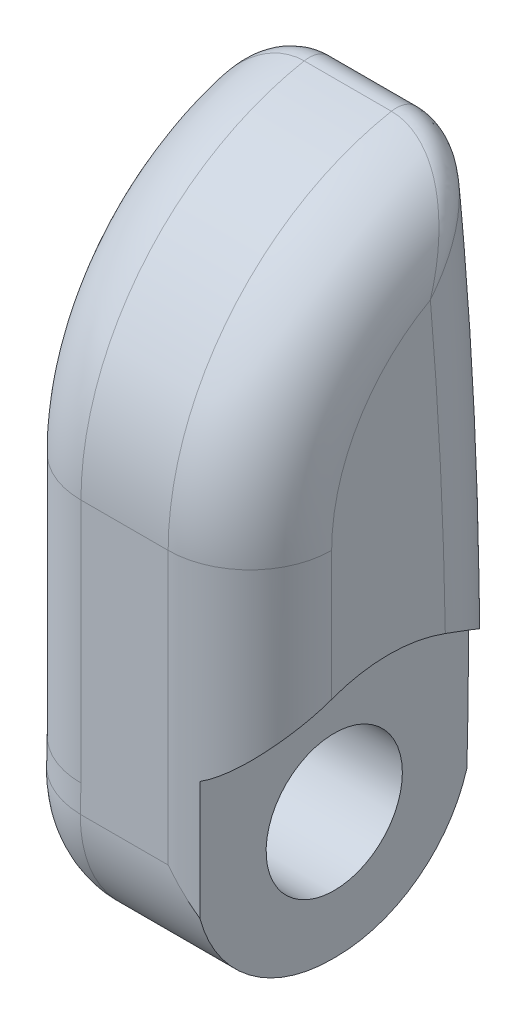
ISO-10303-21;
HEADER;
FILE_DESCRIPTION(('STEP AP214'),'2;1');
FILE_NAME('part.step','',(''),(''),'','','');
FILE_SCHEMA(('AUTOMOTIVE_DESIGN { 1 0 10303 214 1 1 1 1 }'));
ENDSEC;
DATA;
#1=APPLICATION_CONTEXT('core data for automotive mechanical design processes');
#2=APPLICATION_PROTOCOL_DEFINITION('international standard','automotive_design',2000,#1);
#3=PRODUCT_CONTEXT('',#1,'mechanical');
#4=PRODUCT('Part','Part','',(#3));
#5=PRODUCT_RELATED_PRODUCT_CATEGORY('part','',(#4));
#6=PRODUCT_DEFINITION_FORMATION('','',#4);
#7=PRODUCT_DEFINITION_CONTEXT('part definition',#1,'design');
#8=PRODUCT_DEFINITION('design','',#6,#7);
#9=PRODUCT_DEFINITION_SHAPE('','',#8);
#10=(LENGTH_UNIT() NAMED_UNIT(*) SI_UNIT(.MILLI.,.METRE.));
#11=(NAMED_UNIT(*) PLANE_ANGLE_UNIT() SI_UNIT($,.RADIAN.));
#12=(NAMED_UNIT(*) SI_UNIT($,.STERADIAN.) SOLID_ANGLE_UNIT());
#13=UNCERTAINTY_MEASURE_WITH_UNIT(LENGTH_MEASURE(1.E-05),#10,'distance_accuracy_value','');
#14=(GEOMETRIC_REPRESENTATION_CONTEXT(3) GLOBAL_UNCERTAINTY_ASSIGNED_CONTEXT((#13)) GLOBAL_UNIT_ASSIGNED_CONTEXT((#10,
#11,#12)) REPRESENTATION_CONTEXT('',''));
#15=CARTESIAN_POINT('',(0.,0.,0.));
#16=DIRECTION('',(0.,0.,1.));
#17=DIRECTION('',(1.,0.,0.));
#18=AXIS2_PLACEMENT_3D('',#15,#16,#17);
#19=CARTESIAN_POINT('',(9.144,0.,6.35));
#20=DIRECTION('',(0.,0.,-1.));
#21=DIRECTION('',(-1.,0.,0.));
#22=AXIS2_PLACEMENT_3D('',#19,#20,#21);
#23=PLANE('',#22);
#24=DIRECTION('',(-1.,0.,0.));
#25=VECTOR('',#24,1.);
#26=CARTESIAN_POINT('',(11.684,19.05,6.35));
#27=LINE('',#26,#25);
#28=CARTESIAN_POINT('',(7.874,19.05,6.35));
#29=VERTEX_POINT('',#28);
#30=CARTESIAN_POINT('',(3.81,19.05,6.35));
#31=VERTEX_POINT('',#30);
#32=EDGE_CURVE('E450',#29,#31,#27,.T.);
#33=ORIENTED_EDGE('',*,*,#32,.T.);
#34=DIRECTION('',(0.,-1.,0.));
#35=VECTOR('',#34,1.);
#36=CARTESIAN_POINT('',(3.81,0.,6.35));
#37=LINE('',#36,#35);
#38=CARTESIAN_POINT('',(3.81,7.62800568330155,6.35));
#39=VERTEX_POINT('',#38);
#40=EDGE_CURVE('E243',#31,#39,#37,.T.);
#41=ORIENTED_EDGE('',*,*,#40,.T.);
#42=CARTESIAN_POINT('',(3.78644261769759,3.47465155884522,6.35));
#43=CARTESIAN_POINT('',(-0.338759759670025,3.78483634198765,6.35));
#44=CARTESIAN_POINT('',(0.,3.75936410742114,2.22712451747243));
#45=CARTESIAN_POINT('',(3.79262147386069,3.55673039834,6.35));
#46=CARTESIAN_POINT('',(-0.297021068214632,3.817254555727,6.35));
#47=CARTESIAN_POINT('',(0.,3.79897551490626,2.26313741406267));
#48=CARTESIAN_POINT('',(3.79739768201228,3.63890094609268,6.35));
#49=CARTESIAN_POINT('',(-0.255183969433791,3.85435293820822,6.35));
#50=CARTESIAN_POINT('',(0.,3.84138364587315,2.29992759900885));
#51=CARTESIAN_POINT('',(3.80456557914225,3.80331790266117,6.35));
#52=CARTESIAN_POINT('',(-0.172740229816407,3.93769106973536,6.35));
#53=CARTESIAN_POINT('',(0.,3.93244230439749,2.37437384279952));
#54=CARTESIAN_POINT('',(3.80695814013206,3.88556427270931,6.35));
#55=CARTESIAN_POINT('',(-0.132124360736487,3.98383035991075,6.35));
#56=CARTESIAN_POINT('',(0.,3.98109054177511,2.41202957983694));
#57=CARTESIAN_POINT('',(3.80978165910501,4.04998272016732,6.35));
#58=CARTESIAN_POINT('',(-0.0530476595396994,4.085160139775,6.35));
#59=CARTESIAN_POINT('',(0.,4.08524127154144,2.48749839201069));
#60=CARTESIAN_POINT('',(3.81021506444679,4.1321547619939,6.35));
#61=CARTESIAN_POINT('',(-0.014559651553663,4.14025236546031,6.35));
#62=CARTESIAN_POINT('',(0.,4.14073512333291,2.52531121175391));
#63=CARTESIAN_POINT('',(3.80959499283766,4.29649868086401,6.35));
#64=CARTESIAN_POINT('',(0.0594074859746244,4.25924580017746,6.35));
#65=CARTESIAN_POINT('',(0.,4.25917351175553,2.60016874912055));
#66=CARTESIAN_POINT('',(3.80854137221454,4.37867055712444,6.35));
#67=CARTESIAN_POINT('',(0.0949281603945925,4.32308312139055,6.35));
#68=CARTESIAN_POINT('',(0.,4.32211876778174,2.63721339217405));
#69=CARTESIAN_POINT('',(3.80544188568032,4.54284228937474,6.35));
#70=CARTESIAN_POINT('',(0.162016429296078,4.45893099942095,6.35));
#71=CARTESIAN_POINT('',(0.,4.45565941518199,2.70924354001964));
#72=CARTESIAN_POINT('',(3.80339784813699,4.62484218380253,6.35));
#73=CARTESIAN_POINT('',(0.19364664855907,4.53089273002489,6.35));
#74=CARTESIAN_POINT('',(0.,4.52624052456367,2.74423270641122));
#75=CARTESIAN_POINT('',(3.79881858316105,4.78882534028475,6.35));
#76=CARTESIAN_POINT('',(0.252202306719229,4.68230253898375,6.35));
#77=CARTESIAN_POINT('',(0.,4.67511904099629,2.81077325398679));
#78=CARTESIAN_POINT('',(3.79628336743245,4.8708086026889,6.35));
#79=CARTESIAN_POINT('',(0.279193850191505,4.76176082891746,6.35));
#80=CARTESIAN_POINT('',(0.,4.75341626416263,2.84232471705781));
#81=CARTESIAN_POINT('',(3.79120589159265,5.0347916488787,6.35));
#82=CARTESIAN_POINT('',(0.327732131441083,4.92710405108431,6.35));
#83=CARTESIAN_POINT('',(0.,4.91722885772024,2.90039908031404));
#84=CARTESIAN_POINT('',(3.78866363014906,5.11679143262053,6.35));
#85=CARTESIAN_POINT('',(0.349346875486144,5.01305172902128,6.35));
#86=CARTESIAN_POINT('',(0.,5.00274569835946,2.92692095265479));
#87=CARTESIAN_POINT('',(3.78400794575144,5.28080384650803,6.35));
#88=CARTESIAN_POINT('',(0.386495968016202,5.18996863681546,6.35));
#89=CARTESIAN_POINT('',(0.,5.17986836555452,2.97334015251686));
#90=CARTESIAN_POINT('',(3.78189452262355,5.36281647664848,6.35));
#91=CARTESIAN_POINT('',(0.402093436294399,5.28105252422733,6.35));
#92=CARTESIAN_POINT('',(0.,5.2714741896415,2.99323748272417));
#93=CARTESIAN_POINT('',(3.77844143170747,5.52685906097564,6.35));
#94=CARTESIAN_POINT('',(0.426739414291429,5.46656423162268,6.35));
#95=CARTESIAN_POINT('',(0.,5.45903741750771,3.02505197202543));
#96=CARTESIAN_POINT('',(3.77710176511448,5.60888901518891,6.35));
#97=CARTESIAN_POINT('',(0.435835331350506,5.56115392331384,6.35));
#98=CARTESIAN_POINT('',(0.,5.55499482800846,3.03696911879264));
#99=CARTESIAN_POINT('',(3.77541089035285,5.77295914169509,6.35));
#100=CARTESIAN_POINT('',(0.447207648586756,5.75178553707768,6.35));
#101=CARTESIAN_POINT('',(0.,5.74900819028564,3.05193757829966));
#102=CARTESIAN_POINT('',(3.77505967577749,5.85499931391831,6.35));
#103=CARTESIAN_POINT('',(0.44950759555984,5.84802084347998,6.35));
#104=CARTESIAN_POINT('',(0.,5.84706412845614,3.05498894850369));
#105=CARTESIAN_POINT('',(3.77540167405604,6.01907590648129,6.35));
#106=CARTESIAN_POINT('',(0.447240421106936,6.03995817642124,6.35));
#107=CARTESIAN_POINT('',(0.,6.04275099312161,3.05198996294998));
#108=CARTESIAN_POINT('',(3.77609486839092,6.10111232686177,6.35));
#109=CARTESIAN_POINT('',(0.442668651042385,6.13586208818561,6.35));
#110=CARTESIAN_POINT('',(0.,6.14038192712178,3.0459397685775));
#111=CARTESIAN_POINT('',(3.77841505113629,6.26517167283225,6.35));
#112=CARTESIAN_POINT('',(0.426835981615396,6.32520354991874,6.35));
#113=CARTESIAN_POINT('',(0.,6.33275441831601,3.02520222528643));
#114=CARTESIAN_POINT('',(3.78004204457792,6.34719459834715,6.35));
#115=CARTESIAN_POINT('',(0.415542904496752,6.41882629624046,6.35));
#116=CARTESIAN_POINT('',(0.,6.42749595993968,3.0105148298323));
#117=CARTESIAN_POINT('',(3.7839686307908,6.5112473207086,6.35));
#118=CARTESIAN_POINT('',(0.386646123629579,6.60187557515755,6.35));
#119=CARTESIAN_POINT('',(0.,6.61201347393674,2.9735631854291));
#120=CARTESIAN_POINT('',(3.78626841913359,6.59327711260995,6.35));
#121=CARTESIAN_POINT('',(0.368986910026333,6.69144836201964,6.35));
#122=CARTESIAN_POINT('',(0.,6.70178799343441,2.95129673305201));
#123=CARTESIAN_POINT('',(3.79116057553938,6.75732845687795,6.35));
#124=CARTESIAN_POINT('',(0.327909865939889,6.86488052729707,6.35));
#125=CARTESIAN_POINT('',(0.,6.87480534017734,2.90064844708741));
#126=CARTESIAN_POINT('',(3.79375294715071,6.83935000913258,6.35));
#127=CARTESIAN_POINT('',(0.304425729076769,6.94883709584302,6.35));
#128=CARTESIAN_POINT('',(0.,6.95804808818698,2.87226653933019));
#129=CARTESIAN_POINT('',(3.79877363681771,7.00339584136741,6.35));
#130=CARTESIAN_POINT('',(0.252378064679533,7.10985106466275,6.35));
#131=CARTESIAN_POINT('',(0.,7.11708880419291,2.81100328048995));
#132=CARTESIAN_POINT('',(3.80120196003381,7.08542012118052,6.35));
#133=CARTESIAN_POINT('',(0.223745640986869,7.18695254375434,6.35));
#134=CARTESIAN_POINT('',(0.,7.19288700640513,2.77812207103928));
#135=CARTESIAN_POINT('',(3.80540066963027,7.2494848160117,6.35));
#136=CARTESIAN_POINT('',(0.162168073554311,7.33337704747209,6.35));
#137=CARTESIAN_POINT('',(0.,7.33669980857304,2.70942596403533));
#138=CARTESIAN_POINT('',(3.80717107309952,7.3315252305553,6.35));
#139=CARTESIAN_POINT('',(0.129159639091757,7.40269535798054,6.35));
#140=CARTESIAN_POINT('',(0.,7.40471461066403,2.67361114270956));
#141=CARTESIAN_POINT('',(3.80943738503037,7.48755728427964,6.35));
#142=CARTESIAN_POINT('',(0.0630998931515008,7.52649202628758,6.35));
#143=CARTESIAN_POINT('',(0.,7.52676081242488,2.6040237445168));
#144=CARTESIAN_POINT('',(3.8100414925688,7.56154716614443,6.35));
#145=CARTESIAN_POINT('',(0.0303046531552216,7.58177661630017,6.35));
#146=CARTESIAN_POINT('',(0.,7.58150957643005,2.57039661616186));
#147=CARTESIAN_POINT('',(3.8099540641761,7.70952813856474,6.35));
#148=CARTESIAN_POINT('',(-0.0375004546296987,7.68525254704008,6.35));
#149=CARTESIAN_POINT('',(0.,7.68506370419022,2.50271520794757));
#150=CARTESIAN_POINT('',(3.80926252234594,7.78351922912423,6.35));
#151=CARTESIAN_POINT('',(-0.0725381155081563,7.73339230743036,6.35));
#152=CARTESIAN_POINT('',(0.,7.73386904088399,2.4686609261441));
#153=CARTESIAN_POINT('',(3.80624945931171,7.93138066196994,6.35));
#154=CARTESIAN_POINT('',(-0.144143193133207,7.82237318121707,6.35));
#155=CARTESIAN_POINT('',(0.,7.82589650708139,2.40083822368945));
#156=CARTESIAN_POINT('',(3.80392995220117,8.00525104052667,6.35));
#157=CARTESIAN_POINT('',(-0.180725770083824,7.86315971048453,6.35));
#158=CARTESIAN_POINT('',(0.,7.86912545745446,2.36706950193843));
#159=CARTESIAN_POINT('',(3.79735605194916,8.15290379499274,6.35));
#160=CARTESIAN_POINT('',(-0.254823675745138,7.93747832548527,6.35));
#161=CARTESIAN_POINT('',(0.,7.95054774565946,2.3002789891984));
#162=CARTESIAN_POINT('',(3.79310162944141,8.22668616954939,6.35));
#163=CARTESIAN_POINT('',(-0.292344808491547,7.97093950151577,6.35));
#164=CARTESIAN_POINT('',(0.,7.98874100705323,2.26725720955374));
#165=CARTESIAN_POINT('',(3.77698848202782,8.44796600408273,6.35));
#166=CARTESIAN_POINT('',(-0.405946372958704,8.06100250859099,6.35));
#167=CARTESIAN_POINT('',(0.,8.09660733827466,2.16982599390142));
#168=CARTESIAN_POINT('',(3.76178161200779,8.59525553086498,6.35));
#169=CARTESIAN_POINT('',(-0.48191238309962,8.10592241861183,6.35));
#170=CARTESIAN_POINT('',(0.,8.15948145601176,2.10711667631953));
#171=CARTESIAN_POINT('',(3.73080867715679,8.81533767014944,6.35));
#172=CARTESIAN_POINT('',(-0.592715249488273,8.15284873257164,6.35));
#173=CARTESIAN_POINT('',(0.,8.24315975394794,2.01762406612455));
#174=CARTESIAN_POINT('',(3.71909026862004,8.88871140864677,6.35));
#175=CARTESIAN_POINT('',(-0.629415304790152,8.16508912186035,6.35));
#176=CARTESIAN_POINT('',(0.,8.26932459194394,1.98849808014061));
#177=CARTESIAN_POINT('',(3.69273292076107,9.03495544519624,6.35));
#178=CARTESIAN_POINT('',(-0.701309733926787,8.18300195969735,6.35));
#179=CARTESIAN_POINT('',(0.,8.31847410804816,1.93187556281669));
#180=CARTESIAN_POINT('',(3.67809304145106,9.10782557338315,6.35));
#181=CARTESIAN_POINT('',(-0.736475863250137,8.18861058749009,6.35));
#182=CARTESIAN_POINT('',(0.,8.34145775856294,1.90437955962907));
#183=CARTESIAN_POINT('',(3.66190053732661,9.18036439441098,6.35));
#184=CARTESIAN_POINT('',(-0.770445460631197,8.19110312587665,6.35));
#185=CARTESIAN_POINT('',(0.,8.363059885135,1.8777328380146));
#186=(BOUNDED_SURFACE() B_SPLINE_SURFACE(3,2,((#42,#43,#44),(#45,#46,#47),(#48,#49,#50),(#51,
#52,#53),(#54,#55,#56),(#57,#58,#59),(#60,#61,#62),(#63,#64,#65),(#66,#67,#68),(#69,#70,#71),
(#72,#73,#74),(#75,#76,#77),(#78,#79,#80),(#81,#82,#83),(#84,#85,#86),(#87,#88,#89),(#90,#91,
#92),(#93,#94,#95),(#96,#97,#98),(#99,#100,#101),(#102,#103,#104),(#105,#106,#107),(#108,#109,
#110),(#111,#112,#113),(#114,#115,#116),(#117,#118,#119),(#120,#121,#122),(#123,#124,#125),
(#126,#127,#128),(#129,#130,#131),(#132,#133,#134),(#135,#136,#137),(#138,#139,#140),(#141,#142,
#143),(#144,#145,#146),(#147,#148,#149),(#150,#151,#152),(#153,#154,#155),(#156,#157,#158),
(#159,#160,#161),(#162,#163,#164),(#165,#166,#167),(#168,#169,#170),(#171,#172,#173),(#174,#175,
#176),(#177,#178,#179),(#180,#181,#182),(#183,#184,#185)),.UNSPECIFIED.,.F.,.F.,
.F.) B_SPLINE_SURFACE_WITH_KNOTS((4,2,2,2,2,2,2,2,2,2,2,2,2,2,2,2,2,2,2,2,2,2,2,4),(3,3),(0.,
0.246901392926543,0.493712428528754,0.740215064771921,0.986741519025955,1.2328145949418,
1.47888180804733,1.72499925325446,1.97111659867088,2.21723432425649,2.46335045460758,
2.70946222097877,2.95557531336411,3.20176001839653,3.44794770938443,3.69412765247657,
3.94030120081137,4.16226966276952,4.38423913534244,4.60593447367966,4.82763317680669,
5.27145200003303,5.4943108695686,5.71724156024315),(0.,1.),
.UNSPECIFIED.) GEOMETRIC_REPRESENTATION_ITEM() RATIONAL_B_SPLINE_SURFACE(((1.,0.677451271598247,
1.),(1.,0.680940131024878,1.),(1.,0.684475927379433,1.),(1.,0.691575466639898,1.),(1.,
0.69513919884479,1.),(1.,0.702226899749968,1.),(1.,0.705750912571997,1.),(1.,0.712676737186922,
1.),(1.,0.716078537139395,1.),(1.,0.722648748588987,1.),(1.,0.72581757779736,1.),(1.,
0.731808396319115,1.),(1.,0.734630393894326,1.),(1.,0.739799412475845,1.),(1.,0.74214633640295,
1.),(1.,0.746239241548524,1.),(1.,0.747985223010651,1.),(1.,0.750770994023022,1.),(1.,
0.751810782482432,1.),(1.,0.753116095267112,1.),(1.,0.753381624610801,1.),(1.,0.753120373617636,
1.),(1.,0.752593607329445,1.),(1.,0.750783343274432,1.),(1.,0.749499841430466,1.),(1.,
0.746257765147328,1.),(1.,0.744298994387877,1.),(1.,0.739820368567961,1.),(1.,0.737300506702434,
1.),(1.,0.731827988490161,1.),(1.,0.728875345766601,1.),(1.,0.722664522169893,1.),(1.,
0.719406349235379,1.),(1.,0.713029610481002,1.),(1.,0.709928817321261,1.),(1.,0.703645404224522,
1.),(1.,0.700462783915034,1.),(1.,0.694080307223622,1.),(1.,0.690880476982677,1.),(1.,
0.684507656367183,1.),(1.,0.681334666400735,1.),(1.,0.671907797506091,1.),(1.,0.665752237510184,
1.),(1.,0.656852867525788,1.),(1.,0.653936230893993,1.),(1.,0.648229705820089,1.),(1.,
0.645439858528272,1.),(1.,0.642719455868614,1.))) REPRESENTATION_ITEM('') SURFACE());
#187=CARTESIAN_POINT('',(3.66190053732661,9.18036439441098,6.35));
#188=CARTESIAN_POINT('',(3.67809304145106,9.10782557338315,6.35));
#189=CARTESIAN_POINT('',(3.69273292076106,9.03495544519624,6.35));
#190=CARTESIAN_POINT('',(3.71909026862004,8.88871140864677,6.35));
#191=CARTESIAN_POINT('',(3.73080867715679,8.81533767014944,6.35));
#192=CARTESIAN_POINT('',(3.76178161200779,8.59525553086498,6.35));
#193=CARTESIAN_POINT('',(3.77698848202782,8.44796600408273,6.35));
#194=CARTESIAN_POINT('',(3.79310162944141,8.22668616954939,6.35));
#195=CARTESIAN_POINT('',(3.79735605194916,8.15290379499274,6.35));
#196=CARTESIAN_POINT('',(3.80392995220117,8.00525104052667,6.35));
#197=CARTESIAN_POINT('',(3.80624945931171,7.93138066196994,6.35));
#198=CARTESIAN_POINT('',(3.80926252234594,7.78351922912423,6.35));
#199=CARTESIAN_POINT('',(3.8099540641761,7.70952813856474,6.35));
#200=CARTESIAN_POINT('',(3.8100414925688,7.56154716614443,6.35));
#201=CARTESIAN_POINT('',(3.80943738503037,7.48755728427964,6.35));
#202=CARTESIAN_POINT('',(3.80717107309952,7.3315252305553,6.35));
#203=CARTESIAN_POINT('',(3.80540066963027,7.2494848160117,6.35));
#204=CARTESIAN_POINT('',(3.80120196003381,7.08542012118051,6.35));
#205=CARTESIAN_POINT('',(3.79877363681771,7.00339584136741,6.35));
#206=CARTESIAN_POINT('',(3.79375294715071,6.83935000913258,6.35));
#207=CARTESIAN_POINT('',(3.79116057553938,6.75732845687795,6.35));
#208=CARTESIAN_POINT('',(3.78626841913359,6.59327711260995,6.35));
#209=CARTESIAN_POINT('',(3.7839686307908,6.5112473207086,6.35));
#210=CARTESIAN_POINT('',(3.78004204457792,6.34719459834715,6.35));
#211=CARTESIAN_POINT('',(3.77841505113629,6.26517167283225,6.35));
#212=CARTESIAN_POINT('',(3.77609486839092,6.10111232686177,6.35));
#213=CARTESIAN_POINT('',(3.77540167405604,6.01907590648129,6.35));
#214=CARTESIAN_POINT('',(3.77505967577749,5.85499931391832,6.35));
#215=CARTESIAN_POINT('',(3.77541089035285,5.77295914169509,6.35));
#216=CARTESIAN_POINT('',(3.77710176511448,5.60888901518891,6.35));
#217=CARTESIAN_POINT('',(3.77844143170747,5.52685906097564,6.35));
#218=CARTESIAN_POINT('',(3.78189452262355,5.36281647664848,6.35));
#219=CARTESIAN_POINT('',(3.78400794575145,5.28080384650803,6.35));
#220=CARTESIAN_POINT('',(3.78866363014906,5.11679143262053,6.35));
#221=CARTESIAN_POINT('',(3.79120589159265,5.0347916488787,6.35));
#222=CARTESIAN_POINT('',(3.79628336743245,4.8708086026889,6.35));
#223=CARTESIAN_POINT('',(3.79881858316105,4.78882534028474,6.35));
#224=CARTESIAN_POINT('',(3.80339784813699,4.62484218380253,6.35));
#225=CARTESIAN_POINT('',(3.80544188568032,4.54284228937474,6.35));
#226=CARTESIAN_POINT('',(3.80854137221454,4.37867055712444,6.35));
#227=CARTESIAN_POINT('',(3.80959499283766,4.29649868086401,6.35));
#228=CARTESIAN_POINT('',(3.8102150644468,4.1321547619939,6.35));
#229=CARTESIAN_POINT('',(3.80978165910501,4.04998272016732,6.35));
#230=CARTESIAN_POINT('',(3.80695814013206,3.88556427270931,6.35));
#231=CARTESIAN_POINT('',(3.80456557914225,3.80331790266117,6.35));
#232=CARTESIAN_POINT('',(3.79739768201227,3.63890094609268,6.35));
#233=CARTESIAN_POINT('',(3.79262147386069,3.55673039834,6.35));
#234=CARTESIAN_POINT('',(3.78644261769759,3.47465155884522,6.35));
#235=B_SPLINE_CURVE_WITH_KNOTS('',3,(#187,#188,#189,#190,#191,#192,#193,#194,#195,#196,#197,
#198,#199,#200,#201,#202,#203,#204,#205,#206,#207,#208,#209,#210,#211,#212,#213,#214,#215,#216,
#217,#218,#219,#220,#221,#222,#223,#224,#225,#226,#227,#228,#229,#230,#231,#232,#233,#234),
.UNSPECIFIED.,.F.,.F.,(4,2,2,2,2,2,2,2,2,2,2,2,2,2,2,2,2,2,2,2,2,2,2,4),(0.,0.222930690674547,
0.44578956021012,0.889608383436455,1.11130708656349,1.33300242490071,1.55497189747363,
1.77694035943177,2.02311390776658,2.26929385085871,2.51548154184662,2.76166624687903,
3.00777933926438,3.25389110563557,3.50000723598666,3.74612496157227,3.99224230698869,
4.23835975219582,4.48442696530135,4.73050004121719,4.97702649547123,5.22352913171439,
5.47034016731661,5.71724156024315),.UNSPECIFIED.);
#236=CARTESIAN_POINT('',(3.78021721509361,6.35,6.35));
#237=VERTEX_POINT('',#236);
#238=EDGE_CURVE('E235',#39,#237,#235,.T.);
#239=ORIENTED_EDGE('',*,*,#238,.T.);
#240=DIRECTION('',(-1.,0.,0.));
#241=VECTOR('',#240,1.);
#242=CARTESIAN_POINT('',(9.144,6.35,6.35));
#243=LINE('',#242,#241);
#244=CARTESIAN_POINT('',(7.874,6.35,6.35));
#245=VERTEX_POINT('',#244);
#246=EDGE_CURVE('E219',#237,#245,#243,.F.);
#247=ORIENTED_EDGE('',*,*,#246,.T.);
#248=DIRECTION('',(0.,-1.,0.));
#249=VECTOR('',#248,1.);
#250=CARTESIAN_POINT('',(7.874,19.05,6.35));
#251=LINE('',#250,#249);
#252=EDGE_CURVE('E233',#245,#29,#251,.F.);
#253=ORIENTED_EDGE('',*,*,#252,.T.);
#254=EDGE_LOOP('',(#33,#41,#239,#247,#253));
#255=FACE_BOUND('',#254,.T.);
#256=ADVANCED_FACE('F62',(#255),#23,.F.);
#257=CARTESIAN_POINT('',(9.144,0.,0.));
#258=DIRECTION('',(0.,1.,0.));
#259=DIRECTION('',(0.,0.,1.));
#260=AXIS2_PLACEMENT_3D('',#257,#258,#259);
#261=PLANE('',#260);
#262=DIRECTION('',(-1.,0.,0.));
#263=VECTOR('',#262,1.);
#264=CARTESIAN_POINT('',(9.144,0.,0.));
#265=LINE('',#264,#263);
#266=CARTESIAN_POINT('',(9.144,0.,0.));
#267=VERTEX_POINT('',#266);
#268=CARTESIAN_POINT('',(3.65217290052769,0.,0.));
#269=VERTEX_POINT('',#268);
#270=EDGE_CURVE('E201',#267,#269,#265,.T.);
#271=ORIENTED_EDGE('',*,*,#270,.T.);
#272=CARTESIAN_POINT('',(0.,3.96216280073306,2.39678291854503));
#273=CARTESIAN_POINT('',(-0.158151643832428,0.,2.38854232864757));
#274=CARTESIAN_POINT('',(3.8018028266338,0.,2.59487822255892));
#275=CARTESIAN_POINT('',(0.,3.93779204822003,2.37805630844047));
#276=CARTESIAN_POINT('',(-0.131973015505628,0.,2.37273139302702));
#277=CARTESIAN_POINT('',(3.80464004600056,0.,2.54045457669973));
#278=CARTESIAN_POINT('',(0.,3.91274823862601,2.35826442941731));
#279=CARTESIAN_POINT('',(-0.10542112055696,0.,2.35503412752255));
#280=CARTESIAN_POINT('',(3.80670624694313,0.,2.48599518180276));
#281=CARTESIAN_POINT('',(0.,3.86133574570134,2.31624791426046));
#282=CARTESIAN_POINT('',(-0.051946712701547,0.,2.31572260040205));
#283=CARTESIAN_POINT('',(3.80940260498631,0.,2.37704854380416));
#284=CARTESIAN_POINT('',(0.,3.83496726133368,2.2940236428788));
#285=CARTESIAN_POINT('',(-0.0250344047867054,0.,2.29414130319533));
#286=CARTESIAN_POINT('',(3.81003297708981,0.,2.32256130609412));
#287=CARTESIAN_POINT('',(0.,3.75396388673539,2.22330002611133));
#288=CARTESIAN_POINT('',(0.0555960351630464,0.,2.22356090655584));
#289=CARTESIAN_POINT('',(3.80993028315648,0.,2.15923691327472));
#290=CARTESIAN_POINT('',(0.,3.69736922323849,2.17070395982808));
#291=CARTESIAN_POINT('',(0.109795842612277,0.,2.16839723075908));
#292=CARTESIAN_POINT('',(3.80721005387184,0.,2.05039898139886));
#293=CARTESIAN_POINT('',(0.,3.57966730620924,2.05166562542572));
#294=CARTESIAN_POINT('',(0.21694629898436,0.,2.04031383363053));
#295=CARTESIAN_POINT('',(3.79751117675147,0.,1.83286724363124));
#296=CARTESIAN_POINT('',(0.,3.51855731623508,1.98521491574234));
#297=CARTESIAN_POINT('',(0.269873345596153,0.,1.96769122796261));
#298=CARTESIAN_POINT('',(3.79052992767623,0.,1.72417356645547));
#299=CARTESIAN_POINT('',(0.,3.39364529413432,1.83516396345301));
#300=CARTESIAN_POINT('',(0.372251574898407,0.,1.80383801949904));
#301=CARTESIAN_POINT('',(3.77361252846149,0.,1.50699248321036));
#302=CARTESIAN_POINT('',(0.,3.32984239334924,1.75155815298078));
#303=CARTESIAN_POINT('',(0.421738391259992,0.,1.71289992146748));
#304=CARTESIAN_POINT('',(3.76367541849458,0.,1.39850515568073));
#305=CARTESIAN_POINT('',(0.,3.20352419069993,1.56481454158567));
#306=CARTESIAN_POINT('',(0.514402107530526,0.,1.51315472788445));
#307=CARTESIAN_POINT('',(3.74252129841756,0.,1.18258597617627));
#308=CARTESIAN_POINT('',(0.,3.14100257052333,1.46184713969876));
#309=CARTESIAN_POINT('',(0.557728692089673,0.,1.40473144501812));
#310=CARTESIAN_POINT('',(3.73131577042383,0.,1.07515292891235));
#311=CARTESIAN_POINT('',(0.,3.02208055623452,1.23392483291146));
#312=CARTESIAN_POINT('',(0.636045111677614,0.,1.17052797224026));
#313=CARTESIAN_POINT('',(3.70935742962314,0.,0.860240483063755));
#314=CARTESIAN_POINT('',(0.,2.96567988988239,1.10897090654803));
#315=CARTESIAN_POINT('',(0.671205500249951,0.,1.0447866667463));
#316=CARTESIAN_POINT('',(3.69860459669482,0.,0.75276108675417));
#317=CARTESIAN_POINT('',(0.,2.89114080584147,0.906049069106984));
#318=CARTESIAN_POINT('',(0.715948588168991,0.,0.845041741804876));
#319=CARTESIAN_POINT('',(3.68425013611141,0.,0.591518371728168));
#320=CARTESIAN_POINT('',(0.,2.86799470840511,0.835926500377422));
#321=CARTESIAN_POINT('',(0.72949708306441,0.,0.776918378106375));
#322=CARTESIAN_POINT('',(3.67976573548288,0.,0.537835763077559));
#323=CARTESIAN_POINT('',(0.,2.82597773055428,0.691095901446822));
#324=CARTESIAN_POINT('',(0.753677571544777,0.,0.63767048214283));
#325=CARTESIAN_POINT('',(3.67160057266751,0.,0.430410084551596));
#326=CARTESIAN_POINT('',(0.,2.80710673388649,0.616387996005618));
#327=CARTESIAN_POINT('',(0.764333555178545,0.,0.566495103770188));
#328=CARTESIAN_POINT('',(3.66791978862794,0.,0.376667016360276));
#329=CARTESIAN_POINT('',(0.,2.77451630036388,0.463251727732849));
#330=CARTESIAN_POINT('',(0.782503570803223,0.,0.421826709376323));
#331=CARTESIAN_POINT('',(3.661554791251,0.,0.26912741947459));
#332=CARTESIAN_POINT('',(0.,2.7607962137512,0.384823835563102));
#333=CARTESIAN_POINT('',(0.790038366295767,0.,0.348263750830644));
#334=CARTESIAN_POINT('',(3.65887045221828,0.,0.215330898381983));
#335=CARTESIAN_POINT('',(0.,2.73919588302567,0.2254240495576));
#336=CARTESIAN_POINT('',(0.801806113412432,0.,0.199631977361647));
#337=CARTESIAN_POINT('',(3.65464233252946,0.,0.1076936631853));
#338=CARTESIAN_POINT('',(0.,2.7313155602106,0.144452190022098));
#339=CARTESIAN_POINT('',(0.806053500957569,0.,0.124477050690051));
#340=CARTESIAN_POINT('',(3.65309853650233,0.,0.0538529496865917));
#341=CARTESIAN_POINT('',(0.,2.71878292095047,-0.0718433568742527));
#342=CARTESIAN_POINT('',(0.812795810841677,0.,-0.0756186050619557));
#343=CARTESIAN_POINT('',(3.65064329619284,0.,-0.0889914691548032));
#344=CARTESIAN_POINT('',(0.,2.71959184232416,-0.208157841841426));
#345=CARTESIAN_POINT('',(0.812363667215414,0.,-0.201502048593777));
#346=CARTESIAN_POINT('',(3.65080171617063,0.,-0.178016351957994));
#347=CARTESIAN_POINT('',(0.,2.73837682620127,-0.477021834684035));
#348=CARTESIAN_POINT('',(0.802245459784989,0.,-0.450505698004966));
#349=CARTESIAN_POINT('',(3.65448192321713,0.,-0.355996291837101));
#350=CARTESIAN_POINT('',(0.,2.75635382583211,-0.609571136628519));
#351=CARTESIAN_POINT('',(0.792523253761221,0.,-0.574058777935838));
#352=CARTESIAN_POINT('',(3.65800389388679,0.,-0.444951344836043));
#353=CARTESIAN_POINT('',(0.,2.8069239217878,-0.865279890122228));
#354=CARTESIAN_POINT('',(0.76447225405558,0.,-0.814924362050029));
#355=CARTESIAN_POINT('',(3.66788680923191,0.,-0.622936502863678));
#356=CARTESIAN_POINT('',(0.,2.8395562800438,-0.988413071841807));
#357=CARTESIAN_POINT('',(0.74603200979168,0.,-0.932553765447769));
#358=CARTESIAN_POINT('',(3.67425537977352,0.,-0.711966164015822));
#359=CARTESIAN_POINT('',(0.,2.91536779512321,-1.22112709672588));
#360=CARTESIAN_POINT('',(0.701634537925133,0.,-1.15839329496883));
#361=CARTESIAN_POINT('',(3.68893552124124,0.,-0.889863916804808));
#362=CARTESIAN_POINT('',(0.,2.95854769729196,-1.33070698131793));
#363=CARTESIAN_POINT('',(0.67556422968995,0.,-1.26679100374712));
#364=CARTESIAN_POINT('',(3.69724722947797,0.,-0.978731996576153));
#365=CARTESIAN_POINT('',(0.,3.0513735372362,-1.53535175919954));
#366=CARTESIAN_POINT('',(0.61708495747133,0.,-1.47286713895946));
#367=CARTESIAN_POINT('',(3.71479263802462,0.,-1.15677117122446));
#368=CARTESIAN_POINT('',(0.,3.10104727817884,-1.63035018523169));
#369=CARTESIAN_POINT('',(0.584541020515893,0.,-1.57053541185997));
#370=CARTESIAN_POINT('',(3.72403026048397,0.,-1.24594186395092));
#371=CARTESIAN_POINT('',(0.,3.20302750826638,-1.80561377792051));
#372=CARTESIAN_POINT('',(0.514572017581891,0.,-1.75371057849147));
#373=CARTESIAN_POINT('',(3.74232080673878,0.,-1.424292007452));
#374=CARTESIAN_POINT('',(0.,3.25533368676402,-1.8858806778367));
#375=CARTESIAN_POINT('',(0.477063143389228,0.,-1.83915191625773));
#376=CARTESIAN_POINT('',(3.75137375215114,0.,-1.51347145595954));
#377=CARTESIAN_POINT('',(0.,3.35965828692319,-2.03278848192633));
#378=CARTESIAN_POINT('',(0.398671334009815,0.,-1.99732033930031));
#379=CARTESIAN_POINT('',(3.76827367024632,0.,-1.69157205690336));
#380=CARTESIAN_POINT('',(0.,3.41167699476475,-2.09948517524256));
#381=CARTESIAN_POINT('',(0.357750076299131,0.,-2.06996950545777));
#382=CARTESIAN_POINT('',(3.7761255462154,0.,-1.78049272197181));
#383=CARTESIAN_POINT('',(0.,3.4883510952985,-2.19097226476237));
#384=CARTESIAN_POINT('',(0.294858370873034,0.,-2.16958342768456));
#385=CARTESIAN_POINT('',(3.78639611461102,0.,-1.91400789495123));
#386=CARTESIAN_POINT('',(0.,3.51368816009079,-2.22004635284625));
#387=CARTESIAN_POINT('',(0.273538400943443,0.,-2.20135556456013));
#388=CARTESIAN_POINT('',(3.78956888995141,0.,-1.95854380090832));
#389=CARTESIAN_POINT('',(0.,3.56377361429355,-2.27556638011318));
#390=CARTESIAN_POINT('',(0.230473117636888,0.,-2.26191328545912));
#391=CARTESIAN_POINT('',(3.79531925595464,0.,-2.04765695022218));
#392=CARTESIAN_POINT('',(0.,3.58852196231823,-2.30201213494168));
#393=CARTESIAN_POINT('',(0.208727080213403,0.,-2.29067750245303));
#394=CARTESIAN_POINT('',(3.79789680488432,0.,-2.09223419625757));
#395=CARTESIAN_POINT('',(0.,3.61290727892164,-2.32725698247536));
#396=CARTESIAN_POINT('',(0.186913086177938,0.,-2.31789065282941));
#397=CARTESIAN_POINT('',(3.80013053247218,0.,-2.1368301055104));
#398=(BOUNDED_SURFACE() B_SPLINE_SURFACE(3,2,((#272,#273,#274),(#275,#276,#277),(#278,#279,
#280),(#281,#282,#283),(#284,#285,#286),(#287,#288,#289),(#290,#291,#292),(#293,#294,#295),
(#296,#297,#298),(#299,#300,#301),(#302,#303,#304),(#305,#306,#307),(#308,#309,#310),(#311,#312,
#313),(#314,#315,#316),(#317,#318,#319),(#320,#321,#322),(#323,#324,#325),(#326,#327,#328),
(#329,#330,#331),(#332,#333,#334),(#335,#336,#337),(#338,#339,#340),(#341,#342,#343),(#344,#345,
#346),(#347,#348,#349),(#350,#351,#352),(#353,#354,#355),(#356,#357,#358),(#359,#360,#361),
(#362,#363,#364),(#365,#366,#367),(#368,#369,#370),(#371,#372,#373),(#374,#375,#376),(#377,#378,
#379),(#380,#381,#382),(#383,#384,#385),(#386,#387,#388),(#389,#390,#391),(#392,#393,#394),
(#395,#396,#397)),.UNSPECIFIED.,.F.,.F.,.F.) B_SPLINE_SURFACE_WITH_KNOTS((4,2,2,2,2,2,2,2,2,2,2,
2,2,2,2,2,2,2,2,2,4),(3,3),(0.,0.163480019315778,0.326935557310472,0.653432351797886,
0.980128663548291,1.30693117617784,1.63098181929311,1.95501804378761,2.11662194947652,
2.27822146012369,2.43980057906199,2.6013775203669,2.86838182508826,3.135400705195,
3.40313924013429,3.67089670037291,3.93984059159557,4.20875281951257,4.47653611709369,
4.61047874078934,4.74443075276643),(0.,1.),
.UNSPECIFIED.) GEOMETRIC_REPRESENTATION_ITEM() RATIONAL_B_SPLINE_SURFACE(((1.,0.692842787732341,
1.),(1.,0.69515085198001,1.),(1.,0.697511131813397,1.),(1.,0.702331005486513,1.),(1.,
0.704790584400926,1.),(1.,0.712305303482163,1.),(1.,0.717502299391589,1.),(1.,0.728186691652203,
1.),(1.,0.733674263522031,1.),(1.,0.744761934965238,1.),(1.,0.750362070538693,1.),(1.,
0.761327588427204,1.),(1.,0.766694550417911,1.),(1.,0.776805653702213,1.),(1.,0.781549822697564,
1.),(1.,0.78777511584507,1.),(1.,0.789699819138,1.),(1.,0.793183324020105,1.),(1.,
0.794742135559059,1.),(1.,0.797428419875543,1.),(1.,0.798555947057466,1.),(1.,0.800328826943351,
1.),(1.,0.800974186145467,1.),(1.,0.802000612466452,1.),(1.,0.801934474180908,1.),(1.,
0.800395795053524,1.),(1.,0.798923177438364,1.),(1.,0.794758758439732,1.),(1.,0.792063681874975,
1.),(1.,0.785757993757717,1.),(1.,0.782147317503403,1.),(1.,0.774320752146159,1.),(1.,
0.770102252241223,1.),(1.,0.761363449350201,1.),(1.,0.756843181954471,1.),(1.,0.747743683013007,
1.),(1.,0.743164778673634,1.),(1.,0.736353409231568,1.),(1.,0.734092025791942,1.),(1.,
0.729601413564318,1.),(1.,0.727372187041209,1.),(1.,0.72516562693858,1.))) REPRESENTATION_ITEM('') SURFACE());
#399=CARTESIAN_POINT('',(3.8018028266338,0.,2.59487822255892));
#400=CARTESIAN_POINT('',(3.80464004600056,0.,2.54045457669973));
#401=CARTESIAN_POINT('',(3.80670624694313,0.,2.48599518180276));
#402=CARTESIAN_POINT('',(3.80940260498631,0.,2.37704854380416));
#403=CARTESIAN_POINT('',(3.81003297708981,0.,2.32256130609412));
#404=CARTESIAN_POINT('',(3.80993028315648,0.,2.15923691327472));
#405=CARTESIAN_POINT('',(3.80721005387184,0.,2.05039898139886));
#406=CARTESIAN_POINT('',(3.79751117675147,0.,1.83286724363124));
#407=CARTESIAN_POINT('',(3.79052992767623,0.,1.72417356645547));
#408=CARTESIAN_POINT('',(3.77361252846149,0.,1.50699248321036));
#409=CARTESIAN_POINT('',(3.76367541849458,0.,1.39850515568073));
#410=CARTESIAN_POINT('',(3.74252129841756,0.,1.18258597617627));
#411=CARTESIAN_POINT('',(3.73131577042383,0.,1.07515292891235));
#412=CARTESIAN_POINT('',(3.70935742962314,0.,0.860240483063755));
#413=CARTESIAN_POINT('',(3.69860459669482,0.,0.75276108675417));
#414=CARTESIAN_POINT('',(3.68425013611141,0.,0.591518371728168));
#415=CARTESIAN_POINT('',(3.67976573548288,0.,0.537835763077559));
#416=CARTESIAN_POINT('',(3.67160057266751,0.,0.430410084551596));
#417=CARTESIAN_POINT('',(3.66791978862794,0.,0.376667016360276));
#418=CARTESIAN_POINT('',(3.661554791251,0.,0.26912741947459));
#419=CARTESIAN_POINT('',(3.65887045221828,0.,0.215330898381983));
#420=CARTESIAN_POINT('',(3.65464233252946,0.,0.1076936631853));
#421=CARTESIAN_POINT('',(3.65309853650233,0.,0.0538529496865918));
#422=CARTESIAN_POINT('',(3.65064329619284,0.,-0.0889914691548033));
#423=CARTESIAN_POINT('',(3.65080171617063,0.,-0.178016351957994));
#424=CARTESIAN_POINT('',(3.65448192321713,0.,-0.355996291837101));
#425=CARTESIAN_POINT('',(3.65800389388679,0.,-0.444951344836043));
#426=CARTESIAN_POINT('',(3.66788680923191,0.,-0.622936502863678));
#427=CARTESIAN_POINT('',(3.67425537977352,0.,-0.711966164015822));
#428=CARTESIAN_POINT('',(3.68893552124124,0.,-0.889863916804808));
#429=CARTESIAN_POINT('',(3.69724722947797,0.,-0.978731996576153));
#430=CARTESIAN_POINT('',(3.71479263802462,0.,-1.15677117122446));
#431=CARTESIAN_POINT('',(3.72403026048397,0.,-1.24594186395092));
#432=CARTESIAN_POINT('',(3.74232080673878,0.,-1.424292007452));
#433=CARTESIAN_POINT('',(3.75137375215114,0.,-1.51347145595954));
#434=CARTESIAN_POINT('',(3.76827367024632,0.,-1.69157205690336));
#435=CARTESIAN_POINT('',(3.7761255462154,0.,-1.78049272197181));
#436=CARTESIAN_POINT('',(3.78639611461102,0.,-1.91400789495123));
#437=CARTESIAN_POINT('',(3.78956888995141,0.,-1.95854380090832));
#438=CARTESIAN_POINT('',(3.79531925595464,0.,-2.04765695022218));
#439=CARTESIAN_POINT('',(3.79789680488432,0.,-2.09223419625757));
#440=CARTESIAN_POINT('',(3.80013053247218,0.,-2.1368301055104));
#441=B_SPLINE_CURVE_WITH_KNOTS('',3,(#399,#400,#401,#402,#403,#404,#405,#406,#407,#408,#409,
#410,#411,#412,#413,#414,#415,#416,#417,#418,#419,#420,#421,#422,#423,#424,#425,#426,#427,#428,
#429,#430,#431,#432,#433,#434,#435,#436,#437,#438,#439,#440),.UNSPECIFIED.,.F.,.F.,(4,2,2,2,2,2,
2,2,2,2,2,2,2,2,2,2,2,2,2,2,4),(0.,0.163480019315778,0.326935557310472,0.653432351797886,
0.980128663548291,1.30693117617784,1.63098181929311,1.95501804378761,2.11662194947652,
2.27822146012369,2.43980057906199,2.6013775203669,2.86838182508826,3.135400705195,
3.40313924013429,3.67089670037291,3.93984059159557,4.20875281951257,4.47653611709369,
4.61047874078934,4.74443075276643),.UNSPECIFIED.);
#442=CARTESIAN_POINT('',(3.65168923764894,0.,-0.209904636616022));
#443=VERTEX_POINT('',#442);
#444=EDGE_CURVE('E803',#269,#443,#441,.T.);
#445=ORIENTED_EDGE('',*,*,#444,.T.);
#446=DIRECTION('',(1.,0.,0.));
#447=VECTOR('',#446,1.);
#448=CARTESIAN_POINT('',(9.144,0.,-0.209904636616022));
#449=LINE('',#448,#447);
#450=CARTESIAN_POINT('',(9.144,0.,-0.209904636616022));
#451=VERTEX_POINT('',#450);
#452=EDGE_CURVE('E196',#443,#451,#449,.T.);
#453=ORIENTED_EDGE('',*,*,#452,.T.);
#454=DIRECTION('',(0.,0.,-1.));
#455=VECTOR('',#454,1.);
#456=CARTESIAN_POINT('',(9.144,0.,0.));
#457=LINE('',#456,#455);
#458=EDGE_CURVE('E188',#267,#451,#457,.T.);
#459=ORIENTED_EDGE('',*,*,#458,.F.);
#460=EDGE_LOOP('',(#271,#445,#453,#459));
#461=FACE_BOUND('',#460,.T.);
#462=ADVANCED_FACE('F200',(#461),#261,.F.);
#463=CARTESIAN_POINT('',(9.144,9.91977981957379,196.60772458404));
#464=DIRECTION('',(-1.,0.,0.));
#465=DIRECTION('',(0.,0.,1.));
#466=AXIS2_PLACEMENT_3D('',#463,#464,#465);
#467=CYLINDRICAL_SURFACE('',#466,203.2);
#468=CARTESIAN_POINT('',(3.81,9.91977981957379,196.60772458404));
#469=DIRECTION('',(1.,0.,0.));
#470=DIRECTION('',(0.,0.,-1.));
#471=AXIS2_PLACEMENT_3D('',#468,#469,#470);
#472=CIRCLE('',#471,203.2);
#473=CARTESIAN_POINT('',(3.81,7.60432280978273,-6.57908271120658));
#474=VERTEX_POINT('',#473);
#475=CARTESIAN_POINT('',(3.81,30.4517727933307,-5.55230426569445));
#476=VERTEX_POINT('',#475);
#477=EDGE_CURVE('E506',#474,#476,#472,.T.);
#478=ORIENTED_EDGE('',*,*,#477,.T.);
#479=DIRECTION('',(-1.,0.,0.));
#480=VECTOR('',#479,1.);
#481=CARTESIAN_POINT('',(9.144,30.4517727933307,-5.55230426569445));
#482=LINE('',#481,#480);
#483=CARTESIAN_POINT('',(7.874,30.4517727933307,-5.55230426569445));
#484=VERTEX_POINT('',#483);
#485=EDGE_CURVE('E12',#476,#484,#482,.F.);
#486=ORIENTED_EDGE('',*,*,#485,.T.);
#487=CARTESIAN_POINT('',(7.874,9.91977981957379,196.60772458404));
#488=DIRECTION('',(1.,0.,0.));
#489=DIRECTION('',(0.,0.,-1.));
#490=AXIS2_PLACEMENT_3D('',#487,#488,#489);
#491=CIRCLE('',#490,203.2);
#492=CARTESIAN_POINT('',(7.874,6.23484581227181,-6.55886041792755));
#493=VERTEX_POINT('',#492);
#494=EDGE_CURVE('E782',#484,#493,#491,.F.);
#495=ORIENTED_EDGE('',*,*,#494,.T.);
#496=DIRECTION('',(-1.,0.,0.));
#497=VECTOR('',#496,1.);
#498=CARTESIAN_POINT('',(9.144,6.23484581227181,-6.55886041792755));
#499=LINE('',#498,#497);
#500=CARTESIAN_POINT('',(3.77500304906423,6.23484581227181,-6.55886041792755));
#501=VERTEX_POINT('',#500);
#502=EDGE_CURVE('E211',#493,#501,#499,.T.);
#503=ORIENTED_EDGE('',*,*,#502,.T.);
#504=CARTESIAN_POINT('',(0.,4.09126119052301,-2.73315483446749));
#505=CARTESIAN_POINT('',(0.0357291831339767,3.98162466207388,-6.50549224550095));
#506=CARTESIAN_POINT('',(3.80975737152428,4.00479928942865,-6.50616712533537));
#507=CARTESIAN_POINT('',(0.,4.13119496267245,-2.76074674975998));
#508=CARTESIAN_POINT('',(0.0615614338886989,4.02357049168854,-6.50672042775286));
#509=CARTESIAN_POINT('',(3.80940756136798,4.06296276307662,-6.50786093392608));
#510=CARTESIAN_POINT('',(0.,4.17295978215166,-2.78825764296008));
#511=CARTESIAN_POINT('',(0.0868072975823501,4.0677787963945,-6.50800332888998));
#512=CARTESIAN_POINT('',(3.80868769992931,4.12112268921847,-6.50952963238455));
#513=CARTESIAN_POINT('',(0.,4.26025489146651,-2.84267960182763));
#514=CARTESIAN_POINT('',(0.135621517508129,4.16026323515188,-6.51065439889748));
#515=CARTESIAN_POINT('',(3.8066755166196,4.23743061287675,-6.51281670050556));
#516=CARTESIAN_POINT('',(0.,4.30578496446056,-2.86959070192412));
#517=CARTESIAN_POINT('',(0.159206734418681,4.2085233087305,-6.51202231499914));
#518=CARTESIAN_POINT('',(3.80538322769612,4.29557861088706,-6.51443507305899));
#519=CARTESIAN_POINT('',(0.,4.40071770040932,-2.92237810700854));
#520=CARTESIAN_POINT('',(0.204424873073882,4.30894365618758,-6.51482837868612));
#521=CARTESIAN_POINT('',(3.80239377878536,4.41186352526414,-6.51762154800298));
#522=CARTESIAN_POINT('',(0.,4.45012029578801,-2.94825443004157));
#523=CARTESIAN_POINT('',(0.226077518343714,4.36109633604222,-6.51626655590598));
#524=CARTESIAN_POINT('',(3.80069662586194,4.47000044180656,-6.51918965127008));
#525=CARTESIAN_POINT('',(0.,4.55278799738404,-2.99846282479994));
#526=CARTESIAN_POINT('',(0.26716338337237,4.46903431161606,-6.51919626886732));
#527=CARTESIAN_POINT('',(3.7970673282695,4.58626870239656,-6.52227576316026));
#528=CARTESIAN_POINT('',(0.,4.60605316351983,-3.02279487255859));
#529=CARTESIAN_POINT('',(0.286618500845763,4.52482255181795,-6.52068814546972));
#530=CARTESIAN_POINT('',(3.79513517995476,4.64440004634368,-6.52379377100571));
#531=CARTESIAN_POINT('',(0.,4.77132453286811,-3.09257081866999));
#532=CARTESIAN_POINT('',(0.341063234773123,4.69654449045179,-6.52520120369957));
#533=CARTESIAN_POINT('',(3.78924832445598,4.81858769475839,-6.52826759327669));
#534=CARTESIAN_POINT('',(0.,4.88897433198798,-3.13489129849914));
#535=CARTESIAN_POINT('',(0.372634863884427,4.8180041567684,-6.52829245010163));
#536=CARTESIAN_POINT('',(3.78519674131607,4.93464244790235,-6.53114881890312));
#537=CARTESIAN_POINT('',(0.,5.13681193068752,-3.20666350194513));
#538=CARTESIAN_POINT('',(0.424067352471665,5.07066518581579,-6.53446933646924));
#539=CARTESIAN_POINT('',(3.77806540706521,5.16678726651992,-6.53671304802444));
#540=CARTESIAN_POINT('',(0.,5.26699935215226,-3.23611561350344));
#541=CARTESIAN_POINT('',(0.444098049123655,5.20218369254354,-6.53756460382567));
#542=CARTESIAN_POINT('',(3.77498562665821,5.28287733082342,-6.53939605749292));
#543=CARTESIAN_POINT('',(0.,5.53484760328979,-3.27840812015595));
#544=CARTESIAN_POINT('',(0.471290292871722,5.47023485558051,-6.54360099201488));
#545=CARTESIAN_POINT('',(3.77069127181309,5.51507068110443,-6.54456316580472));
#546=CARTESIAN_POINT('',(0.,5.67250644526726,-3.2912529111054));
#547=CARTESIAN_POINT('',(0.478560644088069,5.60725603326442,-6.54655429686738));
#548=CARTESIAN_POINT('',(3.7694762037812,5.63117395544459,-6.54704731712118));
#549=CARTESIAN_POINT('',(0.,5.94855706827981,-3.29870776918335));
#550=CARTESIAN_POINT('',(0.479875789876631,5.88101311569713,-6.55218037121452));
#551=CARTESIAN_POINT('',(3.76925934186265,5.86338628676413,-6.55181655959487));
#552=CARTESIAN_POINT('',(0.,6.08694884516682,-3.29331793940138));
#553=CARTESIAN_POINT('',(0.473926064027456,6.01831202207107,-6.55486476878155));
#554=CARTESIAN_POINT('',(3.7702575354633,5.97949534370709,-6.5541016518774));
#555=CARTESIAN_POINT('',(0.,6.35769481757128,-3.26538160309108));
#556=CARTESIAN_POINT('',(0.449272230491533,6.28753393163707,-6.55986729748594));
#557=CARTESIAN_POINT('',(3.77418224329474,6.21181090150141,-6.55847457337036));
#558=CARTESIAN_POINT('',(0.,6.49004202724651,-3.24281575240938));
#559=CARTESIAN_POINT('',(0.430456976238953,6.41995433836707,-6.56219335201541));
#560=CARTESIAN_POINT('',(3.77711093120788,6.32801736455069,-6.56056217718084));
#561=CARTESIAN_POINT('',(0.,6.74313866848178,-3.18387153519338));
#562=CARTESIAN_POINT('',(0.381281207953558,6.67480497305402,-6.56643569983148));
#563=CARTESIAN_POINT('',(3.7840497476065,6.56040261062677,-6.56453752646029));
#564=CARTESIAN_POINT('',(0.,6.86388750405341,-3.14749245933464));
#565=CARTESIAN_POINT('',(0.35075432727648,6.79757307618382,-6.56835578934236));
#566=CARTESIAN_POINT('',(3.78805993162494,6.67658139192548,-6.56642526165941));
#567=CARTESIAN_POINT('',(0.,7.09192742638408,-3.06492428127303));
#568=CARTESIAN_POINT('',(0.279531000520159,7.03101310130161,-6.57181040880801));
#569=CARTESIAN_POINT('',(3.79599199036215,6.91013038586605,-6.57001973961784));
#570=CARTESIAN_POINT('',(0.,7.19906891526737,-3.01863903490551));
#571=CARTESIAN_POINT('',(0.238547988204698,7.14167440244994,-6.57334046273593));
#572=CARTESIAN_POINT('',(3.79991254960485,7.02750068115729,-6.5717244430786));
#573=CARTESIAN_POINT('',(0.,7.39765428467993,-2.92090360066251));
#574=CARTESIAN_POINT('',(0.148680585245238,7.34723668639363,-6.5760336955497));
#575=CARTESIAN_POINT('',(3.80622655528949,7.26228921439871,-6.57493098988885));
#576=CARTESIAN_POINT('',(0.,7.48909867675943,-2.86945358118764));
#577=CARTESIAN_POINT('',(0.0996310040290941,7.44208843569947,-6.57719420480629));
#578=CARTESIAN_POINT('',(3.80862005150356,7.37970745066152,-6.57643283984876));
#579=CARTESIAN_POINT('',(0.,7.65689199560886,-2.76509649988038));
#580=CARTESIAN_POINT('',(-0.00398052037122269,7.61461135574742,-6.57921587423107));
#581=CARTESIAN_POINT('',(3.81049980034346,7.61426651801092,-6.57922953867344));
#582=CARTESIAN_POINT('',(0.,7.73328080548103,-2.71219372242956));
#583=CARTESIAN_POINT('',(-0.0586409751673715,7.69215100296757,-6.58007439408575));
#584=CARTESIAN_POINT('',(3.80999384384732,7.73140724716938,-6.5805249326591));
#585=CARTESIAN_POINT('',(0.,7.87291440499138,-2.60731106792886));
#586=CARTESIAN_POINT('',(-0.171311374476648,7.82995494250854,-6.58158059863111));
#587=CARTESIAN_POINT('',(3.80483931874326,7.96561664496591,-6.58291240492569));
#588=CARTESIAN_POINT('',(0.,7.93615850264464,-2.55533123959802));
#589=CARTESIAN_POINT('',(-0.22937125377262,7.88996726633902,-6.5822252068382));
#590=CARTESIAN_POINT('',(3.80019053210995,8.08268530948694,-6.58400447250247));
#591=CARTESIAN_POINT('',(0.,8.05156487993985,-2.45377048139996));
#592=CARTESIAN_POINT('',(-0.346730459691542,7.99299471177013,-6.58339545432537));
#593=CARTESIAN_POINT('',(3.78563248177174,8.31680635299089,-6.58598646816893));
#594=CARTESIAN_POINT('',(0.,8.10369792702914,-2.40419613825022));
#595=CARTESIAN_POINT('',(-0.406021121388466,8.03568742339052,-6.58391872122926));
#596=CARTESIAN_POINT('',(3.77570957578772,8.43385789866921,-6.58687586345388));
#597=CARTESIAN_POINT('',(0.,8.19853888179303,-2.30851645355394));
#598=CARTESIAN_POINT('',(-0.523469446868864,8.10444111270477,-6.58493408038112));
#599=CARTESIAN_POINT('',(3.74966656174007,8.66722536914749,-6.58844842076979));
#600=CARTESIAN_POINT('',(0.,8.24124946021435,-2.26241013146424));
#601=CARTESIAN_POINT('',(-0.581568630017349,8.13024135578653,-6.58542536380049));
#602=CARTESIAN_POINT('',(3.73354821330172,8.78354149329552,-6.58913164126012));
#603=CARTESIAN_POINT('',(0.,8.31938645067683,-2.17360078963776));
#604=CARTESIAN_POINT('',(-0.695167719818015,8.16639293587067,-6.58646785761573));
#605=CARTESIAN_POINT('',(3.69412707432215,9.01624844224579,-6.59030023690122));
#606=CARTESIAN_POINT('',(0.,8.35472728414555,-2.13094093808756));
#607=CARTESIAN_POINT('',(-0.750523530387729,8.17632666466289,-6.58701987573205));
#608=CARTESIAN_POINT('',(3.67074696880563,9.13262592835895,-6.59078334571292));
#609=CARTESIAN_POINT('',(0.,8.41898046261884,-2.04962184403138));
#610=CARTESIAN_POINT('',(-0.856058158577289,8.18151855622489,-6.58825061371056));
#611=CARTESIAN_POINT('',(3.61625730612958,9.36362798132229,-6.59154741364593));
#612=CARTESIAN_POINT('',(0.,8.44788494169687,-2.01096752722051));
#613=CARTESIAN_POINT('',(-0.906104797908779,8.17655911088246,-6.58893053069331));
#614=CARTESIAN_POINT('',(3.58513838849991,9.47825024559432,-6.59182812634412));
#615=CARTESIAN_POINT('',(0.,8.47425865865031,-1.974379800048));
#616=CARTESIAN_POINT('',(-0.952193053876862,8.16509884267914,-6.58970644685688));
#617=CARTESIAN_POINT('',(3.54987409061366,9.59159019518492,-6.59201038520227));
#618=(BOUNDED_SURFACE() B_SPLINE_SURFACE(3,2,((#504,#505,#506),(#507,#508,#509),(#510,#511,
#512),(#513,#514,#515),(#516,#517,#518),(#519,#520,#521),(#522,#523,#524),(#525,#526,#527),
(#528,#529,#530),(#531,#532,#533),(#534,#535,#536),(#537,#538,#539),(#540,#541,#542),(#543,#544,
#545),(#546,#547,#548),(#549,#550,#551),(#552,#553,#554),(#555,#556,#557),(#558,#559,#560),
(#561,#562,#563),(#564,#565,#566),(#567,#568,#569),(#570,#571,#572),(#573,#574,#575),(#576,#577,
#578),(#579,#580,#581),(#582,#583,#584),(#585,#586,#587),(#588,#589,#590),(#591,#592,#593),
(#594,#595,#596),(#597,#598,#599),(#600,#601,#602),(#603,#604,#605),(#606,#607,#608),(#609,#610,
#611),(#612,#613,#614),(#615,#616,#617)),.UNSPECIFIED.,.F.,.F.,
.F.) B_SPLINE_SURFACE_WITH_KNOTS((4,2,2,2,2,2,2,2,2,2,2,2,2,2,2,2,2,2,4),(3,3),(0.,
0.171290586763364,0.342571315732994,0.513849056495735,0.685129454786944,1.02708674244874,
1.36903372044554,1.71089016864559,2.05274468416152,2.39498477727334,2.73724244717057,
3.08298611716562,3.42871851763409,3.77352236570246,4.11834436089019,4.46406266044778,
4.80968284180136,5.15911681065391,5.50897551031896),(0.,1.),
.UNSPECIFIED.) GEOMETRIC_REPRESENTATION_ITEM() RATIONAL_B_SPLINE_SURFACE(((1.,0.710446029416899,
1.),(1.,0.712885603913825,1.),(1.,0.715300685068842,1.),(1.,0.720045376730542,1.),(1.,
0.722374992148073,1.),(1.,0.726912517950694,1.),(1.,0.729120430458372,1.),(1.,0.73337354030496,
1.),(1.,0.735418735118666,1.),(1.,0.741238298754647,1.),(1.,0.74470494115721,1.),(1.,
0.750469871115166,1.),(1.,0.752768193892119,1.),(1.,0.755920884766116,1.),(1.,0.756775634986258,
1.),(1.,0.756930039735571,1.),(1.,0.756229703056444,1.),(1.,0.753364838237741,1.),(1.,
0.751198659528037,1.),(1.,0.745663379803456,1.),(1.,0.742294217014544,1.),(1.,0.734660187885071,
1.),(1.,0.730386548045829,1.),(1.,0.721317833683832,1.),(1.,0.7165227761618,1.),(1.,
0.706719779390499,1.),(1.,0.7017124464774,1.),(1.,0.691691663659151,1.),(1.,0.686678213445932,
1.),(1.,0.676782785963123,1.),(1.,0.671901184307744,1.),(1.,0.662379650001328,1.),(1.,
0.657739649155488,1.),(1.,0.648705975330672,1.),(1.,0.64431558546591,1.),(1.,0.635855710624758,
1.),(1.,0.631786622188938,1.),(1.,0.627892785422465,1.))) REPRESENTATION_ITEM('') SURFACE());
#619=CARTESIAN_POINT('',(3.80975737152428,4.00479928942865,-6.50616712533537));
#620=CARTESIAN_POINT('',(3.80940756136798,4.06296276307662,-6.50786093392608));
#621=CARTESIAN_POINT('',(3.80868769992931,4.12112268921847,-6.50952963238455));
#622=CARTESIAN_POINT('',(3.8066755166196,4.23743061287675,-6.51281670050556));
#623=CARTESIAN_POINT('',(3.80538322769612,4.29557861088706,-6.51443507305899));
#624=CARTESIAN_POINT('',(3.80239377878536,4.41186352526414,-6.51762154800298));
#625=CARTESIAN_POINT('',(3.80069662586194,4.47000044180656,-6.51918965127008));
#626=CARTESIAN_POINT('',(3.7970673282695,4.58626870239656,-6.52227576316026));
#627=CARTESIAN_POINT('',(3.79513517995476,4.64440004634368,-6.52379377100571));
#628=CARTESIAN_POINT('',(3.78924832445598,4.81858769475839,-6.52826759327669));
#629=CARTESIAN_POINT('',(3.78519674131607,4.93464244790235,-6.53114881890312));
#630=CARTESIAN_POINT('',(3.77806540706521,5.16678726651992,-6.53671304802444));
#631=CARTESIAN_POINT('',(3.77498562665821,5.28287733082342,-6.53939605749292));
#632=CARTESIAN_POINT('',(3.77069127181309,5.51507068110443,-6.54456316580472));
#633=CARTESIAN_POINT('',(3.7694762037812,5.6311739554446,-6.54704731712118));
#634=CARTESIAN_POINT('',(3.76925934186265,5.86338628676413,-6.55181655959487));
#635=CARTESIAN_POINT('',(3.7702575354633,5.97949534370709,-6.5541016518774));
#636=CARTESIAN_POINT('',(3.77418224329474,6.21181090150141,-6.55847457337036));
#637=CARTESIAN_POINT('',(3.77711093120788,6.32801736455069,-6.56056217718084));
#638=CARTESIAN_POINT('',(3.7840497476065,6.56040261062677,-6.56453752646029));
#639=CARTESIAN_POINT('',(3.78805993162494,6.67658139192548,-6.56642526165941));
#640=CARTESIAN_POINT('',(3.79599199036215,6.91013038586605,-6.57001973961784));
#641=CARTESIAN_POINT('',(3.79991254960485,7.02750068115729,-6.5717244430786));
#642=CARTESIAN_POINT('',(3.80622655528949,7.26228921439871,-6.57493098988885));
#643=CARTESIAN_POINT('',(3.80862005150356,7.37970745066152,-6.57643283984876));
#644=CARTESIAN_POINT('',(3.81049980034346,7.61426651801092,-6.57922953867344));
#645=CARTESIAN_POINT('',(3.80999384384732,7.73140724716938,-6.5805249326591));
#646=CARTESIAN_POINT('',(3.80483931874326,7.96561664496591,-6.58291240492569));
#647=CARTESIAN_POINT('',(3.80019053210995,8.08268530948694,-6.58400447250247));
#648=CARTESIAN_POINT('',(3.78563248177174,8.31680635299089,-6.58598646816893));
#649=CARTESIAN_POINT('',(3.77570957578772,8.43385789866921,-6.58687586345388));
#650=CARTESIAN_POINT('',(3.74966656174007,8.66722536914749,-6.58844842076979));
#651=CARTESIAN_POINT('',(3.73354821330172,8.78354149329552,-6.58913164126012));
#652=CARTESIAN_POINT('',(3.69412707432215,9.01624844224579,-6.59030023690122));
#653=CARTESIAN_POINT('',(3.67074696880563,9.13262592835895,-6.59078334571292));
#654=CARTESIAN_POINT('',(3.61625730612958,9.36362798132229,-6.59154741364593));
#655=CARTESIAN_POINT('',(3.58513838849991,9.47825024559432,-6.59182812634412));
#656=CARTESIAN_POINT('',(3.54987409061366,9.59159019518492,-6.59201038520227));
#657=B_SPLINE_CURVE_WITH_KNOTS('',3,(#619,#620,#621,#622,#623,#624,#625,#626,#627,#628,#629,
#630,#631,#632,#633,#634,#635,#636,#637,#638,#639,#640,#641,#642,#643,#644,#645,#646,#647,#648,
#649,#650,#651,#652,#653,#654,#655,#656),.UNSPECIFIED.,.F.,.F.,(4,2,2,2,2,2,2,2,2,2,2,2,2,2,2,2,
2,2,4),(0.,0.171290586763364,0.342571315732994,0.513849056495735,0.685129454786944,
1.02708674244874,1.36903372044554,1.71089016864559,2.05274468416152,2.39498477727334,
2.73724244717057,3.08298611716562,3.42871851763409,3.77352236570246,4.11834436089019,
4.46406266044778,4.80968284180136,5.15911681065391,5.50897551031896),.UNSPECIFIED.);
#658=EDGE_CURVE('E499',#501,#474,#657,.T.);
#659=ORIENTED_EDGE('',*,*,#658,.T.);
#660=EDGE_LOOP('',(#478,#486,#495,#503,#659));
#661=FACE_BOUND('',#660,.T.);
#662=ADVANCED_FACE('F296',(#661),#467,.T.);
#663=CARTESIAN_POINT('',(9.144,5.89625191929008,-0.121137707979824));
#664=DIRECTION('',(-1.,0.,0.));
#665=DIRECTION('',(0.,0.,1.));
#666=AXIS2_PLACEMENT_3D('',#663,#664,#665);
#667=CYLINDRICAL_SURFACE('',#666,3.175);
#668=CARTESIAN_POINT('',(9.144,5.89625191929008,-0.121137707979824));
#669=DIRECTION('',(1.,0.,0.));
#670=DIRECTION('',(0.,0.,-1.));
#671=AXIS2_PLACEMENT_3D('',#668,#669,#670);
#672=CIRCLE('',#671,3.175);
#673=CARTESIAN_POINT('',(9.144,5.89625191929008,-3.29613770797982));
#674=VERTEX_POINT('',#673);
#675=EDGE_CURVE('E204',#674,#674,#672,.T.);
#676=ORIENTED_EDGE('',*,*,#675,.T.);
#677=EDGE_LOOP('',(#676));
#678=FACE_BOUND('',#677,.T.);
#679=CARTESIAN_POINT('',(0.,5.89625191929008,-0.121137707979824));
#680=DIRECTION('',(1.,0.,0.));
#681=DIRECTION('',(0.,0.,-1.));
#682=AXIS2_PLACEMENT_3D('',#679,#680,#681);
#683=CIRCLE('',#682,3.175);
#684=CARTESIAN_POINT('',(0.,6.38291040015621,-3.258618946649));
#685=VERTEX_POINT('',#684);
#686=CARTESIAN_POINT('',(0.,7.64773762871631,-2.76933007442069));
#687=VERTEX_POINT('',#686);
#688=EDGE_CURVE('E460',#685,#687,#683,.T.);
#689=ORIENTED_EDGE('',*,*,#688,.F.);
#690=CARTESIAN_POINT('',(0.,2.72412199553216,-0.256107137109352));
#691=VERTEX_POINT('',#690);
#692=EDGE_CURVE('E455',#691,#685,#683,.T.);
#693=ORIENTED_EDGE('',*,*,#692,.F.);
#694=CARTESIAN_POINT('',(0.,2.7265907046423,0.0629078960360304));
#695=VERTEX_POINT('',#694);
#696=EDGE_CURVE('E459',#695,#691,#683,.T.);
#697=ORIENTED_EDGE('',*,*,#696,.F.);
#698=CARTESIAN_POINT('',(0.,6.4299160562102,3.00869097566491));
#699=VERTEX_POINT('',#698);
#700=EDGE_CURVE('E476',#699,#695,#683,.T.);
#701=ORIENTED_EDGE('',*,*,#700,.F.);
#702=CARTESIAN_POINT('',(0.,7.62800568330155,2.54));
#703=VERTEX_POINT('',#702);
#704=EDGE_CURVE('E472',#703,#699,#683,.T.);
#705=ORIENTED_EDGE('',*,*,#704,.F.);
#706=EDGE_CURVE('E467',#687,#703,#683,.T.);
#707=ORIENTED_EDGE('',*,*,#706,.F.);
#708=EDGE_LOOP('',(#689,#693,#697,#701,#705,#707));
#709=FACE_BOUND('',#708,.T.);
#710=ADVANCED_FACE('F422',(#678,#709),#667,.F.);
#711=CARTESIAN_POINT('',(9.144,0.,0.));
#712=DIRECTION('',(1.,0.,0.));
#713=DIRECTION('',(0.,0.,-1.));
#714=AXIS2_PLACEMENT_3D('',#711,#712,#713);
#715=PLANE('',#714);
#716=CARTESIAN_POINT('',(9.144,5.89625191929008,-0.121137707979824));
#717=DIRECTION('',(1.,0.,0.));
#718=DIRECTION('',(0.,0.,-1.));
#719=AXIS2_PLACEMENT_3D('',#716,#717,#718);
#720=CIRCLE('',#719,7.62000000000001);
#721=CARTESIAN_POINT('',(9.144,10.2507194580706,6.13210244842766));
#722=VERTEX_POINT('',#721);
#723=CARTESIAN_POINT('',(9.144,10.2511077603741,-6.37410745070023));
#724=VERTEX_POINT('',#723);
#725=EDGE_CURVE('E205',#722,#724,#720,.F.);
#726=ORIENTED_EDGE('',*,*,#725,.F.);
#727=DIRECTION('',(0.,1.,0.));
#728=VECTOR('',#727,1.);
#729=CARTESIAN_POINT('',(9.144,10.2507194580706,6.13210244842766));
#730=LINE('',#729,#728);
#731=CARTESIAN_POINT('',(9.144,4.70081245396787,6.13210244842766));
#732=VERTEX_POINT('',#731);
#733=EDGE_CURVE('E191',#722,#732,#730,.F.);
#734=ORIENTED_EDGE('',*,*,#733,.T.);
#735=CARTESIAN_POINT('',(9.144,6.35,0.));
#736=DIRECTION('',(1.,0.,0.));
#737=DIRECTION('',(0.,0.,-1.));
#738=AXIS2_PLACEMENT_3D('',#735,#736,#737);
#739=CIRCLE('',#738,6.35);
#740=EDGE_CURVE('E182',#732,#267,#739,.T.);
#741=ORIENTED_EDGE('',*,*,#740,.T.);
#742=ORIENTED_EDGE('',*,*,#458,.T.);
#743=CARTESIAN_POINT('',(9.144,6.35,-0.209904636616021));
#744=DIRECTION('',(1.,0.,0.));
#745=DIRECTION('',(0.,0.,-1.));
#746=AXIS2_PLACEMENT_3D('',#743,#744,#745);
#747=CIRCLE('',#746,6.35);
#748=CARTESIAN_POINT('',(9.144,4.56453460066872,-6.30372226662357));
#749=VERTEX_POINT('',#748);
#750=EDGE_CURVE('E195',#451,#749,#747,.T.);
#751=ORIENTED_EDGE('',*,*,#750,.T.);
#752=CARTESIAN_POINT('',(9.144,9.91977981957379,196.60772458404));
#753=DIRECTION('',(1.,0.,0.));
#754=DIRECTION('',(0.,0.,-1.));
#755=AXIS2_PLACEMENT_3D('',#752,#753,#754);
#756=CIRCLE('',#755,202.982102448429);
#757=EDGE_CURVE('E400',#749,#724,#756,.T.);
#758=ORIENTED_EDGE('',*,*,#757,.T.);
#759=EDGE_LOOP('',(#726,#734,#741,#742,#751,#758));
#760=FACE_BOUND('',#759,.T.);
#761=ORIENTED_EDGE('',*,*,#675,.F.);
#762=EDGE_LOOP('',(#761));
#763=FACE_BOUND('',#762,.T.);
#764=ADVANCED_FACE('F185',(#760,#763),#715,.T.);
#765=CARTESIAN_POINT('',(0.,0.,0.));
#766=DIRECTION('',(1.,0.,0.));
#767=DIRECTION('',(0.,0.,-1.));
#768=AXIS2_PLACEMENT_3D('',#765,#766,#767);
#769=PLANE('',#768);
#770=ORIENTED_EDGE('',*,*,#706,.T.);
#771=DIRECTION('',(0.,-1.,0.));
#772=VECTOR('',#771,1.);
#773=CARTESIAN_POINT('',(0.,0.,2.54));
#774=LINE('',#773,#772);
#775=CARTESIAN_POINT('',(0.,19.05,2.54));
#776=VERTEX_POINT('',#775);
#777=EDGE_CURVE('E231',#703,#776,#774,.F.);
#778=ORIENTED_EDGE('',*,*,#777,.T.);
#779=CARTESIAN_POINT('',(0.,19.05,-6.38705140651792));
#780=DIRECTION('',(1.,0.,0.));
#781=DIRECTION('',(0.,0.,-1.));
#782=AXIS2_PLACEMENT_3D('',#779,#780,#781);
#783=CIRCLE('',#782,8.92705140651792);
#784=CARTESIAN_POINT('',(0.,26.8590493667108,-2.0614306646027));
#785=VERTEX_POINT('',#784);
#786=EDGE_CURVE('E228',#776,#785,#783,.F.);
#787=ORIENTED_EDGE('',*,*,#786,.T.);
#788=CARTESIAN_POINT('',(0.,9.91977981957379,196.60772458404));
#789=DIRECTION('',(1.,0.,0.));
#790=DIRECTION('',(0.,0.,-1.));
#791=AXIS2_PLACEMENT_3D('',#788,#789,#790);
#792=CIRCLE('',#791,199.39);
#793=EDGE_CURVE('E226',#785,#687,#792,.F.);
#794=ORIENTED_EDGE('',*,*,#793,.T.);
#795=EDGE_LOOP('',(#770,#778,#787,#794));
#796=FACE_BOUND('',#795,.T.);
#797=ADVANCED_FACE('F419',(#796),#769,.F.);
#798=CARTESIAN_POINT('',(11.684,19.05,-6.38705140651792));
#799=DIRECTION('',(1.,0.,0.));
#800=DIRECTION('',(0.,0.,-1.));
#801=AXIS2_PLACEMENT_3D('',#798,#799,#800);
#802=PLANE('',#801);
#803=CARTESIAN_POINT('',(11.684,19.05,-6.38705140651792));
#804=DIRECTION('',(1.,0.,0.));
#805=DIRECTION('',(0.,0.,-1.));
#806=AXIS2_PLACEMENT_3D('',#803,#804,#805);
#807=CIRCLE('',#806,8.92705140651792);
#808=CARTESIAN_POINT('',(11.684,26.8590493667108,-2.06143066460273));
#809=VERTEX_POINT('',#808);
#810=CARTESIAN_POINT('',(11.684,19.05,2.54));
#811=VERTEX_POINT('',#810);
#812=EDGE_CURVE('E571',#809,#811,#807,.T.);
#813=ORIENTED_EDGE('',*,*,#812,.T.);
#814=DIRECTION('',(0.,-1.,0.));
#815=VECTOR('',#814,1.);
#816=CARTESIAN_POINT('',(11.684,9.91977981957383,2.54));
#817=LINE('',#816,#815);
#818=CARTESIAN_POINT('',(11.684,13.0364722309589,2.54));
#819=VERTEX_POINT('',#818);
#820=EDGE_CURVE('E567',#811,#819,#817,.T.);
#821=ORIENTED_EDGE('',*,*,#820,.T.);
#822=CARTESIAN_POINT('',(11.684,5.89625191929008,-0.121137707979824));
#823=DIRECTION('',(1.,0.,0.));
#824=DIRECTION('',(0.,0.,-1.));
#825=AXIS2_PLACEMENT_3D('',#822,#823,#824);
#826=CIRCLE('',#825,7.62000000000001);
#827=CARTESIAN_POINT('',(11.684,13.0455563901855,-2.75777298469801));
#828=VERTEX_POINT('',#827);
#829=EDGE_CURVE('E456',#819,#828,#826,.F.);
#830=ORIENTED_EDGE('',*,*,#829,.T.);
#831=CARTESIAN_POINT('',(11.684,9.91977981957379,196.60772458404));
#832=DIRECTION('',(1.,0.,0.));
#833=DIRECTION('',(0.,0.,-1.));
#834=AXIS2_PLACEMENT_3D('',#831,#832,#833);
#835=CIRCLE('',#834,199.39);
#836=EDGE_CURVE('E789',#828,#809,#835,.T.);
#837=ORIENTED_EDGE('',*,*,#836,.T.);
#838=EDGE_LOOP('',(#813,#821,#830,#837));
#839=FACE_BOUND('',#838,.T.);
#840=ADVANCED_FACE('F415',(#839),#802,.T.);
#841=CARTESIAN_POINT('',(11.684,19.05,-6.38705140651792));
#842=DIRECTION('',(-1.,0.,0.));
#843=DIRECTION('',(0.,0.,1.));
#844=AXIS2_PLACEMENT_3D('',#841,#842,#843);
#845=CYLINDRICAL_SURFACE('',#844,12.7370514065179);
#846=CARTESIAN_POINT('',(7.874,19.05,-6.38705140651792));
#847=DIRECTION('',(1.,0.,0.));
#848=DIRECTION('',(0.,0.,-1.));
#849=AXIS2_PLACEMENT_3D('',#846,#847,#848);
#850=CIRCLE('',#849,12.7370514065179);
#851=CARTESIAN_POINT('',(7.874,31.5720058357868,-4.05641879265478));
#852=VERTEX_POINT('',#851);
#853=EDGE_CURVE('E222',#29,#852,#850,.F.);
#854=ORIENTED_EDGE('',*,*,#853,.T.);
#855=DIRECTION('',(-1.,0.,0.));
#856=VECTOR('',#855,1.);
#857=CARTESIAN_POINT('',(11.684,31.5720058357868,-4.05641879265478));
#858=LINE('',#857,#856);
#859=CARTESIAN_POINT('',(3.81,31.5720058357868,-4.05641879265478));
#860=VERTEX_POINT('',#859);
#861=EDGE_CURVE('E75',#852,#860,#858,.T.);
#862=ORIENTED_EDGE('',*,*,#861,.T.);
#863=CARTESIAN_POINT('',(3.81,19.05,-6.38705140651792));
#864=DIRECTION('',(1.,0.,0.));
#865=DIRECTION('',(0.,0.,-1.));
#866=AXIS2_PLACEMENT_3D('',#863,#864,#865);
#867=CIRCLE('',#866,12.7370514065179);
#868=EDGE_CURVE('E224',#860,#31,#867,.T.);
#869=ORIENTED_EDGE('',*,*,#868,.T.);
#870=ORIENTED_EDGE('',*,*,#32,.F.);
#871=EDGE_LOOP('',(#854,#862,#869,#870));
#872=FACE_BOUND('',#871,.T.);
#873=ADVANCED_FACE('F413',(#872),#845,.T.);
#874=CARTESIAN_POINT('',(11.684,5.89625191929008,-0.121137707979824));
#875=DIRECTION('',(-1.,0.,0.));
#876=DIRECTION('',(0.,0.,1.));
#877=AXIS2_PLACEMENT_3D('',#874,#875,#876);
#878=CYLINDRICAL_SURFACE('',#877,7.62000000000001);
#879=ORIENTED_EDGE('',*,*,#829,.F.);
#880=CARTESIAN_POINT('',(11.684,13.0364722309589,2.54));
#881=CARTESIAN_POINT('',(11.684011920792,12.9939941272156,2.65404684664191));
#882=CARTESIAN_POINT('',(11.6788809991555,12.9487589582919,2.76700164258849));
#883=CARTESIAN_POINT('',(11.6590040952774,12.8533422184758,2.98978809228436));
#884=CARTESIAN_POINT('',(11.6442694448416,12.803166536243,3.0996232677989));
#885=CARTESIAN_POINT('',(11.6060233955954,12.6988000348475,3.31454422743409));
#886=CARTESIAN_POINT('',(11.5825911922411,12.6446488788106,3.41966355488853));
#887=CARTESIAN_POINT('',(11.5276075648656,12.5325010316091,3.6256429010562));
#888=CARTESIAN_POINT('',(11.4960538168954,12.4745032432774,3.72650169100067));
#889=CARTESIAN_POINT('',(11.3905238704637,12.2961814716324,4.0210478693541));
#890=CARTESIAN_POINT('',(11.3054543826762,12.1709434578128,4.20789527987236));
#891=CARTESIAN_POINT('',(11.1096769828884,11.9114833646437,4.56178771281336));
#892=CARTESIAN_POINT('',(10.9988713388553,11.7772284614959,4.728753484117));
#893=CARTESIAN_POINT('',(10.8042110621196,11.5600320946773,4.97800182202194));
#894=CARTESIAN_POINT('',(10.7276280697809,11.4783407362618,5.06718493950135));
#895=CARTESIAN_POINT('',(10.5667222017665,11.3145722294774,5.237984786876));
#896=CARTESIAN_POINT('',(10.4823973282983,11.2324949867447,5.31959955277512));
#897=CARTESIAN_POINT('',(10.3063974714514,11.0694609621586,5.47483724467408));
#898=CARTESIAN_POINT('',(10.2147467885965,10.9885014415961,5.54848482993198));
#899=CARTESIAN_POINT('',(10.0237264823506,10.8289646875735,5.68781680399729));
#900=CARTESIAN_POINT('',(9.92436044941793,10.750386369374,5.75350486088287));
#901=CARTESIAN_POINT('',(9.71688868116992,10.5971422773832,5.87683952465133));
#902=CARTESIAN_POINT('',(9.60874262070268,10.5224974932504,5.93444527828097));
#903=CARTESIAN_POINT('',(9.43978181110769,10.4158890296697,6.01394655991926));
#904=CARTESIAN_POINT('',(9.38228995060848,10.3812207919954,6.0393130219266));
#905=CARTESIAN_POINT('',(9.26493682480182,10.3141450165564,6.08759297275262));
#906=CARTESIAN_POINT('',(9.20507363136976,10.2817393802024,6.11050440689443));
#907=CARTESIAN_POINT('',(9.144,10.2507194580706,6.13210244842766));
#908=B_SPLINE_CURVE_WITH_KNOTS('',3,(#880,#881,#882,#883,#884,#885,#886,#887,#888,#889,#890,
#891,#892,#893,#894,#895,#896,#897,#898,#899,#900,#901,#902,#903,#904,#905,#906,#907),
.UNSPECIFIED.,.F.,.F.,(4,2,2,2,2,2,2,2,2,2,2,2,2,4),(0.,0.364868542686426,0.729307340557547,
1.09050604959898,1.45180822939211,2.1704225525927,2.89181174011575,3.32090161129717,
3.75010252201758,4.17793452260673,4.60556860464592,5.03529183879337,5.25049289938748,
5.46587268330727),.UNSPECIFIED.);
#909=EDGE_CURVE('E392',#819,#722,#908,.T.);
#910=ORIENTED_EDGE('',*,*,#909,.T.);
#911=ORIENTED_EDGE('',*,*,#725,.T.);
#912=CARTESIAN_POINT('',(9.144,10.2511077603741,-6.37410745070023));
#913=CARTESIAN_POINT('',(9.20116638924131,10.2802054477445,-6.35384463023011));
#914=CARTESIAN_POINT('',(9.25726556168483,10.3105264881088,-6.33242379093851));
#915=CARTESIAN_POINT('',(9.36737687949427,10.3731969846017,-6.28740442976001));
#916=CARTESIAN_POINT('',(9.42139017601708,10.4055452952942,-6.26380713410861));
#917=CARTESIAN_POINT('',(9.58022635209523,10.5049054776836,-6.19003328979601));
#918=CARTESIAN_POINT('',(9.68210344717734,10.5743679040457,-6.136781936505));
#919=CARTESIAN_POINT('',(9.87815868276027,10.717147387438,-6.02297565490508));
#920=CARTESIAN_POINT('',(9.97235934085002,10.7904520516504,-5.96244348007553));
#921=CARTESIAN_POINT('',(10.1539066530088,10.9394533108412,-5.834296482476));
#922=CARTESIAN_POINT('',(10.2412489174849,11.0151513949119,-5.76667718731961));
#923=CARTESIAN_POINT('',(10.4084634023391,11.1668871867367,-5.6252694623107));
#924=CARTESIAN_POINT('',(10.4883960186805,11.2429156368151,-5.55154233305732));
#925=CARTESIAN_POINT('',(10.6417130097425,11.3949775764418,-5.39751267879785));
#926=CARTESIAN_POINT('',(10.7150956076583,11.4710110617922,-5.31720838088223));
#927=CARTESIAN_POINT('',(10.8552295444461,11.6222922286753,-5.15001357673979));
#928=CARTESIAN_POINT('',(10.921970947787,11.6975385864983,-5.06311353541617));
#929=CARTESIAN_POINT('',(11.0483924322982,11.8463543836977,-4.88289587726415));
#930=CARTESIAN_POINT('',(11.1080701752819,11.9199232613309,-4.78957615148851));
#931=CARTESIAN_POINT('',(11.2179942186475,12.0621854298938,-4.59989280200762));
#932=CARTESIAN_POINT('',(11.2684882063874,12.1309594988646,-4.50373367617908));
#933=CARTESIAN_POINT('',(11.3618326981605,12.2655126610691,-4.30578065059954));
#934=CARTESIAN_POINT('',(11.4046843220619,12.3312921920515,-4.2039875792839));
#935=CARTESIAN_POINT('',(11.4819681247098,12.4589940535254,-3.99537603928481));
#936=CARTESIAN_POINT('',(11.5164252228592,12.5209273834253,-3.88857359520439));
#937=CARTESIAN_POINT('',(11.5763291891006,12.6404527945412,-3.67017265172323));
#938=CARTESIAN_POINT('',(11.6017803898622,12.6980469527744,-3.55857648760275));
#939=CARTESIAN_POINT('',(11.6424130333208,12.8069534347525,-3.33389059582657));
#940=CARTESIAN_POINT('',(11.6578247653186,12.8583827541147,-3.22089984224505));
#941=CARTESIAN_POINT('',(11.6786323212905,12.9560402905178,-2.99158345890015));
#942=CARTESIAN_POINT('',(11.6840118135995,13.0022599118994,-2.87525270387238));
#943=CARTESIAN_POINT('',(11.684,13.0455563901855,-2.75777298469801));
#944=B_SPLINE_CURVE_WITH_KNOTS('',3,(#912,#913,#914,#915,#916,#917,#918,#919,#920,#921,#922,
#923,#924,#925,#926,#927,#928,#929,#930,#931,#932,#933,#934,#935,#936,#937,#938,#939,#940,#941,
#942,#943),.UNSPECIFIED.,.F.,.F.,(4,2,2,2,2,2,2,2,2,2,2,2,2,2,2,4),(0.,0.201734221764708,
0.403355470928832,0.805685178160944,1.2067887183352,1.60814691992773,2.00587653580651,
2.40371371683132,2.80213740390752,3.20069260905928,3.58599079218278,3.97123246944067,
4.3553162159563,4.73921493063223,5.11396474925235,5.48932409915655),.UNSPECIFIED.);
#945=EDGE_CURVE('E401',#724,#828,#944,.T.);
#946=ORIENTED_EDGE('',*,*,#945,.T.);
#947=EDGE_LOOP('',(#879,#910,#911,#946));
#948=FACE_BOUND('',#947,.T.);
#949=ADVANCED_FACE('F408',(#948),#878,.F.);
#950=CARTESIAN_POINT('',(9.144,6.35,-0.209904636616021));
#951=DIRECTION('',(-1.,0.,0.));
#952=DIRECTION('',(0.,0.,1.));
#953=AXIS2_PLACEMENT_3D('',#950,#951,#952);
#954=CYLINDRICAL_SURFACE('',#953,6.35);
#955=ORIENTED_EDGE('',*,*,#452,.F.);
#956=CARTESIAN_POINT('',(3.79141925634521,8.3973699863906,-6.22079276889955));
#957=CARTESIAN_POINT('',(0.337211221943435,8.44378856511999,-6.20498212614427));
#958=CARTESIAN_POINT('',(0.,7.33982072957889,-2.94898743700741));
#959=CARTESIAN_POINT('',(3.79040552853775,8.22834492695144,-6.2783825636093));
#960=CARTESIAN_POINT('',(0.345346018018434,8.27748112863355,-6.26309578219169));
#961=CARTESIAN_POINT('',(0.,7.26841184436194,-2.98544230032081));
#962=CARTESIAN_POINT('',(3.7893193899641,8.05689046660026,-6.32880657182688));
#963=CARTESIAN_POINT('',(0.353657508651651,8.10861666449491,-6.31431341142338));
#964=CARTESIAN_POINT('',(0.,7.19526848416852,-3.01936857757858));
#965=CARTESIAN_POINT('',(3.78699429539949,7.71036046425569,-6.41504309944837));
#966=CARTESIAN_POINT('',(0.370552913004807,7.76728815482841,-6.40249006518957));
#967=CARTESIAN_POINT('',(0.,7.04581459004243,-3.08182821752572));
#968=CARTESIAN_POINT('',(3.78575534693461,7.5352851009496,-6.45085633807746));
#969=CARTESIAN_POINT('',(0.379135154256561,7.59485305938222,-6.43948020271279));
#970=CARTESIAN_POINT('',(0.,6.96950421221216,-3.11036184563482));
#971=CARTESIAN_POINT('',(3.78311748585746,7.18286070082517,-6.50757676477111));
#972=CARTESIAN_POINT('',(0.39650271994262,7.24764743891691,-6.49893284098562));
#973=CARTESIAN_POINT('',(0.,6.81406679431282,-3.16168566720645));
#974=CARTESIAN_POINT('',(3.78171868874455,7.00551338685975,-6.52849463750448));
#975=CARTESIAN_POINT('',(0.405286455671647,7.07290297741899,-6.52144019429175));
#976=CARTESIAN_POINT('',(0.,6.73494181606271,-3.18447996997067));
#977=CARTESIAN_POINT('',(3.7787559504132,6.64974659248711,-6.55533762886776));
#978=CARTESIAN_POINT('',(0.422995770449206,6.72219941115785,-6.55183833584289));
#979=CARTESIAN_POINT('',(0.,6.57420226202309,-3.22401814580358));
#980=CARTESIAN_POINT('',(3.77719201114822,6.47132712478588,-6.56126292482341));
#981=CARTESIAN_POINT('',(0.431920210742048,6.54625857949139,-6.55976704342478));
#982=CARTESIAN_POINT('',(0.,6.49258771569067,-3.2407620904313));
#983=CARTESIAN_POINT('',(3.77224467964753,5.93613289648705,-6.55641865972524));
#984=CARTESIAN_POINT('',(0.458787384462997,6.01885763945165,-6.56148316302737));
#985=CARTESIAN_POINT('',(0.,6.24445653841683,-3.28142752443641));
#986=CARTESIAN_POINT('',(3.76860489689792,5.57930268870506,-6.523048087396));
#987=CARTESIAN_POINT('',(0.476898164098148,5.66633576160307,-6.53346775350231));
#988=CARTESIAN_POINT('',(0.,6.07459987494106,-3.29580025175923));
#989=CARTESIAN_POINT('',(3.76066453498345,4.87661139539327,-6.39692431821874));
#990=CARTESIAN_POINT('',(0.512948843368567,4.97052289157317,-6.41895912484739));
#991=CARTESIAN_POINT('',(0.,5.72999881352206,-3.29646364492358));
#992=CARTESIAN_POINT('',(3.75636407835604,4.53074829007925,-6.30418212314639));
#993=CARTESIAN_POINT('',(0.530886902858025,4.62723286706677,-6.33281545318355));
#994=CARTESIAN_POINT('',(0.,5.55525532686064,-3.28275951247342));
#995=CARTESIAN_POINT('',(3.74717603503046,3.85932990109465,-6.0619476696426));
#996=CARTESIAN_POINT('',(0.566156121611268,3.95868132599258,-6.10393169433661));
#997=CARTESIAN_POINT('',(0.,5.20504877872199,-3.22506166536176));
#998=CARTESIAN_POINT('',(3.74228819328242,3.53378353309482,-5.91243069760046));
#999=CARTESIAN_POINT('',(0.583490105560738,3.63333200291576,-5.96149117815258));
#1000=CARTESIAN_POINT('',(0.,5.02958543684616,-3.18105475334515));
#1001=CARTESIAN_POINT('',(3.73207849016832,2.91241428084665,-5.56088291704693));
#1002=CARTESIAN_POINT('',(0.617112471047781,3.00983595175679,-5.62322259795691));
#1003=CARTESIAN_POINT('',(0.,4.68333688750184,-3.06104072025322));
#1004=CARTESIAN_POINT('',(3.72675657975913,2.61659476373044,-5.35884616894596));
#1005=CARTESIAN_POINT('',(0.633408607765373,2.71150261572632,-5.42766656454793));
#1006=CARTESIAN_POINT('',(0.,4.51255221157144,-2.9850299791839));
#1007=CARTESIAN_POINT('',(3.71590612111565,2.06291768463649,-4.90788036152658));
#1008=CARTESIAN_POINT('',(0.66456202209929,2.15049715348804,-4.98765356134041));
#1009=CARTESIAN_POINT('',(0.,4.18186207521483,-2.80019962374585));
#1010=CARTESIAN_POINT('',(3.71037745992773,1.80508126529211,-4.65892536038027));
#1011=CARTESIAN_POINT('',(0.679430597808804,1.8875747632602,-4.74336934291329));
#1012=CARTESIAN_POINT('',(0.,4.02196270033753,-2.69136183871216));
#1013=CARTESIAN_POINT('',(3.69941941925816,1.33482803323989,-4.12118688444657));
#1014=CARTESIAN_POINT('',(0.707345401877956,1.40558775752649,-4.21194042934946));
#1015=CARTESIAN_POINT('',(0.,3.72028276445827,-2.44150731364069));
#1016=CARTESIAN_POINT('',(3.69399005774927,1.12241936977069,-3.83239627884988));
#1017=CARTESIAN_POINT('',(0.720406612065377,1.18620530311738,-3.92488073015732));
#1018=CARTESIAN_POINT('',(0.,3.57850545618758,-2.30048480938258));
#1019=CARTESIAN_POINT('',(3.68358784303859,0.748962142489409,-3.22300052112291));
#1020=CARTESIAN_POINT('',(0.7443621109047,0.798437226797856,-3.31529569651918));
#1021=CARTESIAN_POINT('',(0.,3.32069890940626,-1.98877964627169));
#1022=CARTESIAN_POINT('',(3.67861535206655,0.587954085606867,-2.90237053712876));
#1023=CARTESIAN_POINT('',(0.755271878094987,0.629743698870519,-2.99270289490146));
#1024=CARTESIAN_POINT('',(0.,3.20468999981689,-1.81807375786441));
#1025=CARTESIAN_POINT('',(3.66951881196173,0.322249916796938,-2.23874266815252));
#1026=CARTESIAN_POINT('',(0.774586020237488,0.349792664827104,-2.32149272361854));
#1027=CARTESIAN_POINT('',(0.,3.00625053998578,-1.45217976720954));
#1028=CARTESIAN_POINT('',(3.66539386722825,0.217494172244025,-1.89576890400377));
#1029=CARTESIAN_POINT('',(0.783009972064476,0.23815241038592,-1.97272504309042));
#1030=CARTESIAN_POINT('',(0.,2.92378445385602,-1.25701786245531));
#1031=CARTESIAN_POINT('',(3.65965291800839,0.0950110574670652,-1.3271364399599));
#1032=CARTESIAN_POINT('',(0.794484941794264,0.10642639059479,-1.39205458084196));
#1033=CARTESIAN_POINT('',(0.,2.82194097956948,-0.925646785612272));
#1034=CARTESIAN_POINT('',(3.65767392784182,0.0594136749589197,-1.10517840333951));
#1035=CARTESIAN_POINT('',(0.798370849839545,0.0676991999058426,-1.16490074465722));
#1036=CARTESIAN_POINT('',(0.,2.79050816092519,-0.794439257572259));
#1037=CARTESIAN_POINT('',(3.65426018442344,0.0119168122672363,-0.658768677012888));
#1038=CARTESIAN_POINT('',(0.805005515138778,0.0151527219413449,-0.707271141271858));
#1039=CARTESIAN_POINT('',(0.,2.74450381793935,-0.527787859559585));
#1040=CARTESIAN_POINT('',(3.65282511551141,3.57009176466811E-06,-0.434318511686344));
#1041=CARTESIAN_POINT('',(0.807757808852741,0.00127566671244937,-0.476704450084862));
#1042=CARTESIAN_POINT('',(0.,2.72992250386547,-0.392346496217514));
#1043=CARTESIAN_POINT('',(3.65078958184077,-2.82764009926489E-06,-0.0321608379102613));
#1044=CARTESIAN_POINT('',(0.811638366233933,-0.00100960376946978,-0.0631616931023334));
#1045=CARTESIAN_POINT('',(0.,2.71952778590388,-0.148200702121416));
#1046=CARTESIAN_POINT('',(3.65007761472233,0.00746552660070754,0.145560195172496));
#1047=CARTESIAN_POINT('',(0.812986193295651,0.00587319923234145,0.119769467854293));
#1048=CARTESIAN_POINT('',(0.,2.72044195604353,-0.039793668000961));
#1049=CARTESIAN_POINT('',(3.64904525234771,0.0372846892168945,0.499831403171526));
#1050=CARTESIAN_POINT('',(0.814935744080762,0.0354183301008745,0.484528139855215));
#1051=CARTESIAN_POINT('',(0.,2.73339464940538,0.176724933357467));
#1052=CARTESIAN_POINT('',(3.64872498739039,0.0596404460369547,0.676381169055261));
#1053=CARTESIAN_POINT('',(0.815537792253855,0.0580841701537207,0.666409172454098));
#1054=CARTESIAN_POINT('',(0.,2.74543687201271,0.284836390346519));
#1055=CARTESIAN_POINT('',(3.64848467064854,0.119217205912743,1.02771980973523));
#1056=CARTESIAN_POINT('',(0.815989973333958,0.119175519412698,1.0282712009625));
#1057=CARTESIAN_POINT('',(0.,2.78064826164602,0.499775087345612));
#1058=CARTESIAN_POINT('',(3.64856631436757,0.156500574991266,1.20249810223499));
#1059=CARTESIAN_POINT('',(0.8158370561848,0.157674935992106,1.20829550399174));
#1060=CARTESIAN_POINT('',(0.,2.80386419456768,0.606594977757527));
#1061=CARTESIAN_POINT('',(3.64912946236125,0.245631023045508,1.54824978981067));
#1062=CARTESIAN_POINT('',(0.814775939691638,0.250053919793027,1.56416261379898));
#1063=CARTESIAN_POINT('',(0.,2.86107388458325,0.817094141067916));
#1064=CARTESIAN_POINT('',(3.64961086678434,0.297474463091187,1.71922412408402));
#1065=CARTESIAN_POINT('',(0.813867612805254,0.303946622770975,1.74005858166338));
#1066=CARTESIAN_POINT('',(0.,2.89506494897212,0.920774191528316));
#1067=CARTESIAN_POINT('',(3.65029004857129,0.356456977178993,1.8876992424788));
#1068=CARTESIAN_POINT('',(0.812582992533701,0.365350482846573,1.9131109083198));
#1069=CARTESIAN_POINT('',(0.,2.93426527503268,1.02221705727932));
#1070=(BOUNDED_SURFACE() B_SPLINE_SURFACE(3,2,((#956,#957,#958),(#959,#960,#961),(#962,#963,
#964),(#965,#966,#967),(#968,#969,#970),(#971,#972,#973),(#974,#975,#976),(#977,#978,#979),
(#980,#981,#982),(#983,#984,#985),(#986,#987,#988),(#989,#990,#991),(#992,#993,#994),(#995,#996,
#997),(#998,#999,#1000),(#1001,#1002,#1003),(#1004,#1005,#1006),(#1007,#1008,#1009),(#1010,
#1011,#1012),(#1013,#1014,#1015),(#1016,#1017,#1018),(#1019,#1020,#1021),(#1022,#1023,#1024),
(#1025,#1026,#1027),(#1028,#1029,#1030),(#1031,#1032,#1033),(#1034,#1035,#1036),(#1037,#1038,
#1039),(#1040,#1041,#1042),(#1043,#1044,#1045),(#1046,#1047,#1048),(#1049,#1050,#1051),(#1052,
#1053,#1054),(#1055,#1056,#1057),(#1058,#1059,#1060),(#1061,#1062,#1063),(#1064,#1065,#1066),
(#1067,#1068,#1069)),.UNSPECIFIED.,.F.,.F.,.F.) B_SPLINE_SURFACE_WITH_KNOTS((4,2,2,2,2,2,2,2,2,
2,2,2,2,2,2,2,2,2,4),(3,3),(0.,0.21423185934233,0.428453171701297,0.642520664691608,
0.856585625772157,1.28457198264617,1.71247905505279,2.14057260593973,2.56871459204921,
2.99709400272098,3.42555019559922,3.85434321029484,4.2826807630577,4.5520510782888,
4.82126482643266,5.03449172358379,5.24778953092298,5.46198793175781,5.67613284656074),(0.,1.),
.UNSPECIFIED.) GEOMETRIC_REPRESENTATION_ITEM() RATIONAL_B_SPLINE_SURFACE(((1.,0.740818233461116,
1.),(1.,0.741701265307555,1.),(1.,0.742608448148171,1.),(1.,0.744465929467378,1.),(1.,
0.745416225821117,1.),(1.,0.747354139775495,1.),(1.,0.748341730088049,1.),(1.,0.750349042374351,
1.),(1.,0.75136876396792,1.),(1.,0.75446916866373,1.),(1.,0.756591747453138,1.),(1.,
0.760895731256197,1.),(1.,0.76307712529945,1.),(1.,0.767450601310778,1.),(1.,0.769642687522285,
1.),(1.,0.7739807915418,1.),(1.,0.776126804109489,1.),(1.,0.78031205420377,1.),(1.,
0.782351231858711,1.),(1.,0.786253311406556,1.),(1.,0.788116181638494,1.),(1.,0.791592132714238,
1.),(1.,0.793205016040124,1.),(1.,0.796101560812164,1.),(1.,0.797385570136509,1.),(1.,
0.799152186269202,1.),(1.,0.799755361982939,1.),(1.,0.800790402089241,1.),(1.,0.801222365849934,
1.),(1.,0.801833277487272,1.),(1.,0.802046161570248,1.),(1.,0.80235449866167,1.),(1.,
0.802449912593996,1.),(1.,0.802521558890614,1.),(1.,0.802497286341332,1.),(1.,0.802329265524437,
1.),(1.,0.802185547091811,1.),(1.,0.801982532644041,1.))) REPRESENTATION_ITEM('') SURFACE());
#1071=CARTESIAN_POINT('',(3.65029004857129,0.356456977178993,1.8876992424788));
#1072=CARTESIAN_POINT('',(3.64961086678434,0.297474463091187,1.71922412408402));
#1073=CARTESIAN_POINT('',(3.64912946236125,0.245631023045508,1.54824978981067));
#1074=CARTESIAN_POINT('',(3.64856631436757,0.156500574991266,1.20249810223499));
#1075=CARTESIAN_POINT('',(3.64848467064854,0.119217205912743,1.02771980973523));
#1076=CARTESIAN_POINT('',(3.64872498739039,0.0596404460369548,0.676381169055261));
#1077=CARTESIAN_POINT('',(3.64904525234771,0.0372846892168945,0.499831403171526));
#1078=CARTESIAN_POINT('',(3.65007761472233,0.00746552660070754,0.145560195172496));
#1079=CARTESIAN_POINT('',(3.65078958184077,-2.82764009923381E-06,-0.0321608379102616));
#1080=CARTESIAN_POINT('',(3.65282511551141,3.57009176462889E-06,-0.434318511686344));
#1081=CARTESIAN_POINT('',(3.65426018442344,0.0119168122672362,-0.658768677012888));
#1082=CARTESIAN_POINT('',(3.65767392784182,0.0594136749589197,-1.10517840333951));
#1083=CARTESIAN_POINT('',(3.65965291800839,0.0950110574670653,-1.3271364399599));
#1084=CARTESIAN_POINT('',(3.66539386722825,0.217494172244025,-1.89576890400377));
#1085=CARTESIAN_POINT('',(3.66951881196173,0.322249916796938,-2.23874266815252));
#1086=CARTESIAN_POINT('',(3.67861535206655,0.587954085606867,-2.90237053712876));
#1087=CARTESIAN_POINT('',(3.68358784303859,0.748962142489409,-3.22300052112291));
#1088=CARTESIAN_POINT('',(3.69399005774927,1.12241936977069,-3.83239627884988));
#1089=CARTESIAN_POINT('',(3.69941941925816,1.33482803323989,-4.12118688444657));
#1090=CARTESIAN_POINT('',(3.71037745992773,1.80508126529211,-4.65892536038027));
#1091=CARTESIAN_POINT('',(3.71590612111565,2.06291768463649,-4.90788036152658));
#1092=CARTESIAN_POINT('',(3.72675657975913,2.61659476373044,-5.35884616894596));
#1093=CARTESIAN_POINT('',(3.73207849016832,2.91241428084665,-5.56088291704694));
#1094=CARTESIAN_POINT('',(3.74228819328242,3.53378353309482,-5.91243069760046));
#1095=CARTESIAN_POINT('',(3.74717603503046,3.85932990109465,-6.0619476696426));
#1096=CARTESIAN_POINT('',(3.75636407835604,4.53074829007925,-6.30418212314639));
#1097=CARTESIAN_POINT('',(3.76066453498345,4.87661139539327,-6.39692431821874));
#1098=CARTESIAN_POINT('',(3.76860489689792,5.57930268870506,-6.523048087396));
#1099=CARTESIAN_POINT('',(3.77224467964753,5.93613289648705,-6.55641865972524));
#1100=CARTESIAN_POINT('',(3.77719201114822,6.47132712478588,-6.56126292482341));
#1101=CARTESIAN_POINT('',(3.7787559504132,6.64974659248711,-6.55533762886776));
#1102=CARTESIAN_POINT('',(3.78171868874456,7.00551338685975,-6.52849463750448));
#1103=CARTESIAN_POINT('',(3.78311748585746,7.18286070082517,-6.50757676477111));
#1104=CARTESIAN_POINT('',(3.78575534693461,7.5352851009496,-6.45085633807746));
#1105=CARTESIAN_POINT('',(3.78699429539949,7.71036046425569,-6.41504309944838));
#1106=CARTESIAN_POINT('',(3.7893193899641,8.05689046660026,-6.32880657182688));
#1107=CARTESIAN_POINT('',(3.79040552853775,8.22834492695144,-6.2783825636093));
#1108=CARTESIAN_POINT('',(3.79141925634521,8.3973699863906,-6.22079276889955));
#1109=B_SPLINE_CURVE_WITH_KNOTS('',3,(#1071,#1072,#1073,#1074,#1075,#1076,#1077,#1078,#1079,
#1080,#1081,#1082,#1083,#1084,#1085,#1086,#1087,#1088,#1089,#1090,#1091,#1092,#1093,#1094,#1095,
#1096,#1097,#1098,#1099,#1100,#1101,#1102,#1103,#1104,#1105,#1106,#1107,#1108),.UNSPECIFIED.,
.F.,.F.,(4,2,2,2,2,2,2,2,2,2,2,2,2,2,2,2,2,2,4),(0.,0.214144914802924,0.42834331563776,
0.641641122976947,0.854868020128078,1.12408176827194,1.39345208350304,1.8217896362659,
2.25058265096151,2.67903884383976,3.10741825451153,3.53556024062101,3.96365379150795,
4.39156086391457,4.81954722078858,5.03361218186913,5.24767967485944,5.46190098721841,
5.67613284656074),.UNSPECIFIED.);
#1110=EDGE_CURVE('E487',#443,#501,#1109,.T.);
#1111=ORIENTED_EDGE('',*,*,#1110,.T.);
#1112=ORIENTED_EDGE('',*,*,#502,.F.);
#1113=CARTESIAN_POINT('',(9.144,4.56453460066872,-6.30372226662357));
#1114=CARTESIAN_POINT('',(9.04103976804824,4.70111660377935,-6.34372566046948));
#1115=CARTESIAN_POINT('',(8.93721372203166,4.83834960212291,-6.37896273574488));
#1116=CARTESIAN_POINT('',(8.72820461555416,5.11392236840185,-6.44003968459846));
#1117=CARTESIAN_POINT('',(8.62302125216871,5.25226238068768,-6.46587742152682));
#1118=CARTESIAN_POINT('',(8.30735398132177,5.66686766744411,-6.52921292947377));
#1119=CARTESIAN_POINT('',(8.09548988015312,5.94438626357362,-6.55301613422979));
#1120=CARTESIAN_POINT('',(7.88054481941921,6.22626277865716,-6.55870038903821));
#1121=CARTESIAN_POINT('',(7.87727238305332,6.23055429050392,-6.55878257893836));
#1122=CARTESIAN_POINT('',(7.874,6.23484581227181,-6.55886041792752));
#1123=B_SPLINE_CURVE_WITH_KNOTS('',3,(#1113,#1114,#1115,#1116,#1117,#1118,#1119,#1120,#1121,
#1122),.UNSPECIFIED.,.F.,.F.,(4,2,2,2,4),(0.,0.526769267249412,1.05365820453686,
2.10102416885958,2.11721656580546),.UNSPECIFIED.);
#1124=EDGE_CURVE('E786',#493,#749,#1123,.F.);
#1125=ORIENTED_EDGE('',*,*,#1124,.T.);
#1126=ORIENTED_EDGE('',*,*,#750,.F.);
#1127=EDGE_LOOP('',(#955,#1111,#1112,#1125,#1126));
#1128=FACE_BOUND('',#1127,.T.);
#1129=ADVANCED_FACE('F340',(#1128),#954,.T.);
#1130=CARTESIAN_POINT('',(9.144,6.35,0.));
#1131=DIRECTION('',(-1.,0.,0.));
#1132=DIRECTION('',(0.,0.,1.));
#1133=AXIS2_PLACEMENT_3D('',#1130,#1131,#1132);
#1134=CYLINDRICAL_SURFACE('',#1133,6.35);
#1135=ORIENTED_EDGE('',*,*,#246,.F.);
#1136=CARTESIAN_POINT('',(3.64672616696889,0.335573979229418,-2.03695351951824));
#1137=CARTESIAN_POINT('',(0.818872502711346,0.339657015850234,-2.0490093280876));
#1138=CARTESIAN_POINT('',(0.,2.90452263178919,-1.18423736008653));
#1139=CARTESIAN_POINT('',(3.64640330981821,0.27835478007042,-1.86805894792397));
#1140=CARTESIAN_POINT('',(0.819472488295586,0.280351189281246,-1.87512037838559));
#1141=CARTESIAN_POINT('',(0.,2.86788423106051,-1.08124716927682));
#1142=CARTESIAN_POINT('',(3.64628891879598,0.228284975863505,-1.69674918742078));
#1143=CARTESIAN_POINT('',(0.819686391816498,0.228623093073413,-1.69855818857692));
#1144=CARTESIAN_POINT('',(0.,2.836607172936,-0.976255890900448));
#1145=CARTESIAN_POINT('',(3.64647195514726,0.14272307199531,-1.3505377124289));
#1146=CARTESIAN_POINT('',(0.819346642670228,0.140650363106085,-1.34171071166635));
#1147=CARTESIAN_POINT('',(0.,2.785034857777,-0.763672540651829));
#1148=CARTESIAN_POINT('',(3.64676936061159,0.107230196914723,-1.17563618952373));
#1149=CARTESIAN_POINT('',(0.818792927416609,0.10439256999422,-1.16137109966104));
#1150=CARTESIAN_POINT('',(0.,2.76473901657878,-0.656080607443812));
#1151=CARTESIAN_POINT('',(3.64777044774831,0.0511170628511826,-0.823600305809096));
#1152=CARTESIAN_POINT('',(0.816922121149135,0.0476897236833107,-0.798562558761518));
#1153=CARTESIAN_POINT('',(0.,2.73539587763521,-0.439771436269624));
#1154=CARTESIAN_POINT('',(3.64847380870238,0.0304850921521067,-0.646467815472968));
#1155=CARTESIAN_POINT('',(0.815605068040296,0.0272295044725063,-0.616039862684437));
#1156=CARTESIAN_POINT('',(0.,2.72633971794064,-0.331055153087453));
#1157=CARTESIAN_POINT('',(3.65026750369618,0.00417410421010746,-0.291158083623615));
#1158=CARTESIAN_POINT('',(0.812222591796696,0.0021510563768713,-0.250273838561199));
#1159=CARTESIAN_POINT('',(0.,2.71939813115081,-0.113856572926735));
#1160=CARTESIAN_POINT('',(3.65135783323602,-0.00150508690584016,-0.112980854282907));
#1161=CARTESIAN_POINT('',(0.810156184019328,-0.00246044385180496,-0.0669766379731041));
#1162=CARTESIAN_POINT('',(0.,2.72151257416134,-0.00537427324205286));
#1163=CARTESIAN_POINT('',(3.65517260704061,0.00401084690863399,0.42121928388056));
#1164=CARTESIAN_POINT('',(0.802855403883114,0.0074920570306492,0.482024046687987));
#1165=CARTESIAN_POINT('',(0.,2.74434570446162,0.317641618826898));
#1166=CARTESIAN_POINT('',(3.65844189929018,0.0377043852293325,0.777258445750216));
#1167=CARTESIAN_POINT('',(0.796515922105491,0.045881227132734,0.846978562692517));
#1168=CARTESIAN_POINT('',(0.,2.78152612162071,0.529960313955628));
#1169=CARTESIAN_POINT('',(3.66612860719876,0.164203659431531,1.4783340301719));
#1170=CARTESIAN_POINT('',(0.781136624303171,0.183769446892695,1.56226177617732));
#1171=CARTESIAN_POINT('',(0.,2.89570046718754,0.938285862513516));
#1172=CARTESIAN_POINT('',(3.67054583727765,0.256999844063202,1.82337222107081));
#1173=CARTESIAN_POINT('',(0.772081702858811,0.283507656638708,1.91289885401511));
#1174=CARTESIAN_POINT('',(0.,2.9726879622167,1.13429534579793));
#1175=CARTESIAN_POINT('',(3.68016290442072,0.499229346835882,2.49361040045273));
#1176=CARTESIAN_POINT('',(0.751537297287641,0.540044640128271,2.59028361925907));
#1177=CARTESIAN_POINT('',(0.,3.16026825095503,1.5030161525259));
#1178=CARTESIAN_POINT('',(3.68536407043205,0.64875950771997,2.81877535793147));
#1179=CARTESIAN_POINT('',(0.740026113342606,0.697264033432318,2.91716208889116));
#1180=CARTESIAN_POINT('',(0.,3.27091844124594,1.67568695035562));
#1181=CARTESIAN_POINT('',(3.69615276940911,1.0002222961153,3.43941901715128));
#1182=CARTESIAN_POINT('',(0.714905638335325,1.06300027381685,3.53748158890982));
#1183=CARTESIAN_POINT('',(0.,3.5183847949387,1.992342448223));
#1184=CARTESIAN_POINT('',(3.70174034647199,1.20216091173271,3.73489432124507));
#1185=CARTESIAN_POINT('',(0.701278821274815,1.27187053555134,3.83095177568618));
#1186=CARTESIAN_POINT('',(0.,3.6552039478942,2.13632386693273));
#1187=CARTESIAN_POINT('',(3.7129509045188,1.65307203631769,4.28823237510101));
#1188=CARTESIAN_POINT('',(0.672259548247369,1.73440236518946,4.37745413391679));
#1189=CARTESIAN_POINT('',(0.,3.94771662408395,2.39318153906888));
#1190=CARTESIAN_POINT('',(3.71857392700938,1.90211710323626,4.54603599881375));
#1191=CARTESIAN_POINT('',(0.656849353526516,1.98845896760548,4.6303233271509));
#1192=CARTESIAN_POINT('',(0.,4.10343912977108,2.50600913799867));
#1193=CARTESIAN_POINT('',(3.72955033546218,2.44004638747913,5.01621106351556));
#1194=CARTESIAN_POINT('',(0.624654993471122,2.53354326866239,5.08906204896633));
#1195=CARTESIAN_POINT('',(0.,4.42661347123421,2.69955097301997));
#1196=CARTESIAN_POINT('',(3.73490367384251,2.72893760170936,5.22857450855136));
#1197=CARTESIAN_POINT('',(0.607858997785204,2.82484989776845,5.29471826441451));
#1198=CARTESIAN_POINT('',(0.,4.59406736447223,2.78025955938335));
#1199=CARTESIAN_POINT('',(3.74512353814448,3.3384824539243,5.60188639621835));
#1200=CARTESIAN_POINT('',(0.573289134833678,3.43632669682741,5.65435665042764));
#1201=CARTESIAN_POINT('',(0.,4.9345996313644,2.91021672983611));
#1202=CARTESIAN_POINT('',(3.74998975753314,3.65915584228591,5.76280260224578));
#1203=CARTESIAN_POINT('',(0.555507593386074,3.7567067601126,5.80802217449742));
#1204=CARTESIAN_POINT('',(0.,5.10768145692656,2.95944560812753));
#1205=CARTESIAN_POINT('',(3.75908999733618,4.32283747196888,6.02831326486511));
#1206=CARTESIAN_POINT('',(0.51941816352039,4.41733600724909,6.05990268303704));
#1207=CARTESIAN_POINT('',(0.,5.45402965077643,3.02785755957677));
#1208=CARTESIAN_POINT('',(3.76332468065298,4.66582174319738,6.13296708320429));
#1209=CARTESIAN_POINT('',(0.501108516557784,4.75766626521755,6.15784753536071));
#1210=CARTESIAN_POINT('',(0.,5.62729563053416,3.04707234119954));
#1211=CARTESIAN_POINT('',(3.76965315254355,5.23418476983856,6.25523191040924));
#1212=CARTESIAN_POINT('',(0.471291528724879,5.31975831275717,6.27039867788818));
#1213=CARTESIAN_POINT('',(0.,5.90590724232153,3.05567263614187));
#1214=CARTESIAN_POINT('',(3.77195750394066,5.45587137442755,6.290738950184));
#1215=CARTESIAN_POINT('',(0.459767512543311,5.53892685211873,6.3024155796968));
#1216=CARTESIAN_POINT('',(0.,6.01255181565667,3.05349311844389));
#1217=CARTESIAN_POINT('',(3.77629180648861,5.9017189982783,6.33811438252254));
#1218=CARTESIAN_POINT('',(0.436814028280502,5.97930428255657,6.34350329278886));
#1219=CARTESIAN_POINT('',(0.,6.22332547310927,3.03873381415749));
#1220=CARTESIAN_POINT('',(3.77832191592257,6.12587850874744,6.34999646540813));
#1221=CARTESIAN_POINT('',(0.425386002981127,6.2004968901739,6.35250417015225));
#1222=CARTESIAN_POINT('',(0.,6.32745597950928,3.02616005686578));
#1223=CARTESIAN_POINT('',(3.78172320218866,6.52808485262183,6.35000280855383));
#1224=CARTESIAN_POINT('',(0.405082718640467,6.59703984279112,6.34800408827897));
#1225=CARTESIAN_POINT('',(0.,6.51132988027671,2.99481020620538));
#1226=CARTESIAN_POINT('',(3.78314407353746,6.70614570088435,6.34250580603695));
#1227=CARTESIAN_POINT('',(0.396160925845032,6.77256670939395,6.33869951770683));
#1228=CARTESIAN_POINT('',(0.,6.59168903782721,2.97783865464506));
#1229=CARTESIAN_POINT('',(3.78582247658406,7.06109023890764,6.31257252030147));
#1230=CARTESIAN_POINT('',(0.378514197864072,7.1223992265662,6.3056022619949));
#1231=CARTESIAN_POINT('',(0.,6.7499986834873,2.93801302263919));
#1232=CARTESIAN_POINT('',(3.78707995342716,7.23797351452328,6.29013123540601));
#1233=CARTESIAN_POINT('',(0.369790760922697,7.29668316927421,6.28176809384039));
#1234=CARTESIAN_POINT('',(0.,6.82794835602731,2.91515697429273));
#1235=CARTESIAN_POINT('',(3.78944343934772,7.58996992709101,6.23032631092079));
#1236=CARTESIAN_POINT('',(0.352573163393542,7.6435181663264,6.21960631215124));
#1237=CARTESIAN_POINT('',(0.,6.9813940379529,2.86376868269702));
#1238=CARTESIAN_POINT('',(3.79054878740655,7.76507245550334,6.19290015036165));
#1239=CARTESIAN_POINT('',(0.344081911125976,7.81603025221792,6.18118504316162));
#1240=CARTESIAN_POINT('',(0.,7.05687831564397,2.83521291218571));
#1241=CARTESIAN_POINT('',(3.7926113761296,8.11145894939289,6.10342646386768));
#1242=CARTESIAN_POINT('',(0.327434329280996,8.15736526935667,6.09011497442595));
#1243=CARTESIAN_POINT('',(0.,7.20473370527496,2.77281121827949));
#1244=CARTESIAN_POINT('',(3.79356865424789,8.28274387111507,6.05138264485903));
#1245=CARTESIAN_POINT('',(0.319279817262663,8.32615788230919,6.03744100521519));
#1246=CARTESIAN_POINT('',(0.,7.27710560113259,2.73896663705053));
#1247=CARTESIAN_POINT('',(3.79445700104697,8.4515214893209,5.99217051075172));
#1248=CARTESIAN_POINT('',(0.3113339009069,8.49234317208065,5.97785388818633));
#1249=CARTESIAN_POINT('',(0.,7.34778393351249,2.70263278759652));
#1250=(BOUNDED_SURFACE() B_SPLINE_SURFACE(3,2,((#1136,#1137,#1138),(#1139,#1140,#1141),(#1142,
#1143,#1144),(#1145,#1146,#1147),(#1148,#1149,#1150),(#1151,#1152,#1153),(#1154,#1155,#1156),
(#1157,#1158,#1159),(#1160,#1161,#1162),(#1163,#1164,#1165),(#1166,#1167,#1168),(#1169,#1170,
#1171),(#1172,#1173,#1174),(#1175,#1176,#1177),(#1178,#1179,#1180),(#1181,#1182,#1183),(#1184,
#1185,#1186),(#1187,#1188,#1189),(#1190,#1191,#1192),(#1193,#1194,#1195),(#1196,#1197,#1198),
(#1199,#1200,#1201),(#1202,#1203,#1204),(#1205,#1206,#1207),(#1208,#1209,#1210),(#1211,#1212,
#1213),(#1214,#1215,#1216),(#1217,#1218,#1219),(#1220,#1221,#1222),(#1223,#1224,#1225),(#1226,
#1227,#1228),(#1229,#1230,#1231),(#1232,#1233,#1234),(#1235,#1236,#1237),(#1238,#1239,#1240),
(#1241,#1242,#1243),(#1244,#1245,#1246),(#1247,#1248,#1249)),.UNSPECIFIED.,.F.,.F.,
.F.) B_SPLINE_SURFACE_WITH_KNOTS((4,2,2,2,2,2,2,2,2,2,2,2,2,2,2,2,2,2,4),(3,3),(0.,
0.213921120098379,0.427830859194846,0.641571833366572,0.855310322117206,1.28237004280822,
1.70936076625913,2.13708364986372,2.56485542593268,2.99329154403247,3.42180299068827,
3.85058241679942,4.27890855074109,4.54796629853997,4.81686808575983,5.03053494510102,
5.24427335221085,5.4589129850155,5.67349823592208),(0.,1.),
.UNSPECIFIED.) GEOMETRIC_REPRESENTATION_ITEM() RATIONAL_B_SPLINE_SURFACE(((1.,0.802986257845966,
1.),(1.,0.803081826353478,1.),(1.,0.803115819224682,1.),(1.,0.803061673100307,1.),(1.,
0.802973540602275,1.),(1.,0.802676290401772,1.),(1.,0.802467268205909,1.),(1.,0.801932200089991,
1.),(1.,0.801606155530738,1.),(1.,0.800459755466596,1.),(1.,0.799470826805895,1.),(1.,
0.797104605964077,1.),(1.,0.795727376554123,1.),(1.,0.792655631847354,1.),(1.,0.790960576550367,
1.),(1.,0.787332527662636,1.),(1.,0.785399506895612,1.),(1.,0.781367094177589,1.),(1.,
0.779267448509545,1.),(1.,0.77497224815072,1.),(1.,0.772776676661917,1.),(1.,0.768350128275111,
1.),(1.,0.766119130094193,1.),(1.,0.761679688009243,1.),(1.,0.759471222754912,1.),(1.,
0.755936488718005,1.),(1.,0.754587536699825,1.),(1.,0.751929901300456,1.),(1.,0.750621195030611,
1.),(1.,0.748319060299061,1.),(1.,0.747316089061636,1.),(1.,0.745347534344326,1.),(1.,
0.744381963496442,1.),(1.,0.742490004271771,1.),(1.,0.741563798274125,1.),(1.,0.739760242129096,
1.),(1.,0.73888287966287,1.),(1.,0.738032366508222,1.))) REPRESENTATION_ITEM('') SURFACE());
#1251=CARTESIAN_POINT('',(3.79445700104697,8.4515214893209,5.99217051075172));
#1252=CARTESIAN_POINT('',(3.79356865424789,8.28274387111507,6.05138264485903));
#1253=CARTESIAN_POINT('',(3.7926113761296,8.11145894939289,6.10342646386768));
#1254=CARTESIAN_POINT('',(3.79054878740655,7.76507245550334,6.19290015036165));
#1255=CARTESIAN_POINT('',(3.78944343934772,7.58996992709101,6.23032631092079));
#1256=CARTESIAN_POINT('',(3.78707995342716,7.23797351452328,6.29013123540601));
#1257=CARTESIAN_POINT('',(3.78582247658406,7.06109023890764,6.31257252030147));
#1258=CARTESIAN_POINT('',(3.78314407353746,6.70614570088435,6.34250580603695));
#1259=CARTESIAN_POINT('',(3.78172320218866,6.52808485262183,6.35000280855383));
#1260=CARTESIAN_POINT('',(3.77832191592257,6.12587850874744,6.34999646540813));
#1261=CARTESIAN_POINT('',(3.77629180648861,5.9017189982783,6.33811438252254));
#1262=CARTESIAN_POINT('',(3.77195750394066,5.45587137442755,6.290738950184));
#1263=CARTESIAN_POINT('',(3.76965315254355,5.23418476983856,6.25523191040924));
#1264=CARTESIAN_POINT('',(3.76332468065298,4.66582174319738,6.13296708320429));
#1265=CARTESIAN_POINT('',(3.75908999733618,4.32283747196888,6.02831326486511));
#1266=CARTESIAN_POINT('',(3.74998975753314,3.65915584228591,5.76280260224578));
#1267=CARTESIAN_POINT('',(3.74512353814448,3.33848245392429,5.60188639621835));
#1268=CARTESIAN_POINT('',(3.73490367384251,2.72893760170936,5.22857450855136));
#1269=CARTESIAN_POINT('',(3.72955033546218,2.44004638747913,5.01621106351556));
#1270=CARTESIAN_POINT('',(3.71857392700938,1.90211710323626,4.54603599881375));
#1271=CARTESIAN_POINT('',(3.7129509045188,1.65307203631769,4.28823237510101));
#1272=CARTESIAN_POINT('',(3.70174034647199,1.20216091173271,3.73489432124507));
#1273=CARTESIAN_POINT('',(3.69615276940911,1.0002222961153,3.43941901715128));
#1274=CARTESIAN_POINT('',(3.68536407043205,0.648759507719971,2.81877535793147));
#1275=CARTESIAN_POINT('',(3.68016290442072,0.499229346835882,2.49361040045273));
#1276=CARTESIAN_POINT('',(3.67054583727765,0.256999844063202,1.82337222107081));
#1277=CARTESIAN_POINT('',(3.66612860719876,0.164203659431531,1.4783340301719));
#1278=CARTESIAN_POINT('',(3.65844189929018,0.0377043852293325,0.777258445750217));
#1279=CARTESIAN_POINT('',(3.65517260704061,0.00401084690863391,0.421219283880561));
#1280=CARTESIAN_POINT('',(3.65135783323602,-0.00150508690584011,-0.112980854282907));
#1281=CARTESIAN_POINT('',(3.65026750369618,0.00417410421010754,-0.291158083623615));
#1282=CARTESIAN_POINT('',(3.64847380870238,0.0304850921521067,-0.646467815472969));
#1283=CARTESIAN_POINT('',(3.64777044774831,0.0511170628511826,-0.823600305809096));
#1284=CARTESIAN_POINT('',(3.64676936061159,0.107230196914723,-1.17563618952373));
#1285=CARTESIAN_POINT('',(3.64647195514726,0.14272307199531,-1.3505377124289));
#1286=CARTESIAN_POINT('',(3.64628891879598,0.228284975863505,-1.69674918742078));
#1287=CARTESIAN_POINT('',(3.64640330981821,0.27835478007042,-1.86805894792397));
#1288=CARTESIAN_POINT('',(3.64672616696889,0.335573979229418,-2.03695351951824));
#1289=B_SPLINE_CURVE_WITH_KNOTS('',3,(#1251,#1252,#1253,#1254,#1255,#1256,#1257,#1258,#1259,
#1260,#1261,#1262,#1263,#1264,#1265,#1266,#1267,#1268,#1269,#1270,#1271,#1272,#1273,#1274,#1275,
#1276,#1277,#1278,#1279,#1280,#1281,#1282,#1283,#1284,#1285,#1286,#1287,#1288),.UNSPECIFIED.,
.F.,.F.,(4,2,2,2,2,2,2,2,2,2,2,2,2,2,2,2,2,2,4),(0.,0.214585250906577,0.429224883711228,
0.642963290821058,0.856630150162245,1.12553193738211,1.39458968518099,1.82291581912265,
2.2516952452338,2.68020669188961,3.10864280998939,3.53641458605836,3.96413746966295,
4.39112819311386,4.81818791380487,5.0319264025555,5.24566737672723,5.4595771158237,
5.67349823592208),.UNSPECIFIED.);
#1290=EDGE_CURVE('E210',#237,#269,#1289,.T.);
#1291=ORIENTED_EDGE('',*,*,#1290,.T.);
#1292=ORIENTED_EDGE('',*,*,#270,.F.);
#1293=ORIENTED_EDGE('',*,*,#740,.F.);
#1294=CARTESIAN_POINT('',(9.144,4.70081245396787,6.13210244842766));
#1295=CARTESIAN_POINT('',(9.04104463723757,4.836152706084,6.16848696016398));
#1296=CARTESIAN_POINT('',(8.93722297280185,4.97199341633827,6.20022994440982));
#1297=CARTESIAN_POINT('',(8.72822570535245,5.24450867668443,6.2545778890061));
#1298=CARTESIAN_POINT('',(8.62304981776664,5.38118339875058,6.27718089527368));
#1299=CARTESIAN_POINT('',(8.30735799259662,5.79052293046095,6.33126616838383));
#1300=CARTESIAN_POINT('',(8.09546731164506,6.06408671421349,6.34944534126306));
#1301=CARTESIAN_POINT('',(7.88050636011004,6.34160032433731,6.34999583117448));
#1302=CARTESIAN_POINT('',(7.87725315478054,6.34580019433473,6.3499999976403));
#1303=CARTESIAN_POINT('',(7.874,6.35,6.35));
#1304=B_SPLINE_CURVE_WITH_KNOTS('',3,(#1294,#1295,#1296,#1297,#1298,#1299,#1300,#1301,#1302,
#1303),.UNSPECIFIED.,.F.,.F.,(4,2,2,2,4),(0.,0.521499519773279,1.0431104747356,2.08024814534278,
2.0961855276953),.UNSPECIFIED.);
#1305=EDGE_CURVE('E385',#732,#245,#1304,.T.);
#1306=ORIENTED_EDGE('',*,*,#1305,.T.);
#1307=EDGE_LOOP('',(#1135,#1291,#1292,#1293,#1306));
#1308=FACE_BOUND('',#1307,.T.);
#1309=ADVANCED_FACE('F208',(#1308),#1134,.T.);
#1310=CARTESIAN_POINT('',(3.65217290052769,3.81,0.));
#1311=DIRECTION('',(0.0172222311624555,0.,0.999851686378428));
#1312=DIRECTION('',(0.999851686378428,0.,-0.0172222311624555));
#1313=AXIS2_PLACEMENT_3D('',#1310,#1311,#1312);
#1314=CIRCLE('',#1313,3.81);
#1315=EDGE_CURVE('E306',#695,#269,#1314,.T.);
#1316=ORIENTED_EDGE('',*,*,#1315,.F.);
#1317=ORIENTED_EDGE('',*,*,#696,.T.);
#1318=CARTESIAN_POINT('',(3.65168923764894,3.81,-0.209904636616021));
#1319=DIRECTION('',(-0.012651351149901,0.,0.999919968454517));
#1320=DIRECTION('',(0.999919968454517,0.,0.012651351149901));
#1321=AXIS2_PLACEMENT_3D('',#1318,#1319,#1320);
#1322=CIRCLE('',#1321,3.81);
#1323=EDGE_CURVE('E326',#443,#691,#1322,.F.);
#1324=ORIENTED_EDGE('',*,*,#1323,.F.);
#1325=ORIENTED_EDGE('',*,*,#444,.F.);
#1326=EDGE_LOOP('',(#1316,#1317,#1324,#1325));
#1327=FACE_BOUND('',#1326,.T.);
#1328=ADVANCED_FACE('F335',(#1327),#398,.T.);
#1329=ORIENTED_EDGE('',*,*,#1323,.T.);
#1330=ORIENTED_EDGE('',*,*,#692,.T.);
#1331=CARTESIAN_POINT('',(3.77500304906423,6.30393832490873,-2.74948694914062));
#1332=DIRECTION('',(0.0233557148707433,0.999562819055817,-0.0181295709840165));
#1333=DIRECTION('',(-0.999727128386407,0.0233595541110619,0.));
#1334=AXIS2_PLACEMENT_3D('',#1331,#1332,#1333);
#1335=CIRCLE('',#1334,3.81);
#1336=EDGE_CURVE('E281',#501,#685,#1335,.T.);
#1337=ORIENTED_EDGE('',*,*,#1336,.F.);
#1338=ORIENTED_EDGE('',*,*,#1110,.F.);
#1339=EDGE_LOOP('',(#1329,#1330,#1337,#1338));
#1340=FACE_BOUND('',#1339,.T.);
#1341=ADVANCED_FACE('F314',(#1340),#1070,.T.);
#1342=ORIENTED_EDGE('',*,*,#1315,.T.);
#1343=ORIENTED_EDGE('',*,*,#1290,.F.);
#1344=CARTESIAN_POINT('',(3.78021721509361,6.35,2.54));
#1345=DIRECTION('',(-0.0211358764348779,-0.999776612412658,0.));
#1346=DIRECTION('',(0.999776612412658,-0.0211358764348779,0.));
#1347=AXIS2_PLACEMENT_3D('',#1344,#1345,#1346);
#1348=CIRCLE('',#1347,3.81);
#1349=EDGE_CURVE('E488',#699,#237,#1348,.F.);
#1350=ORIENTED_EDGE('',*,*,#1349,.F.);
#1351=ORIENTED_EDGE('',*,*,#700,.T.);
#1352=EDGE_LOOP('',(#1342,#1343,#1350,#1351));
#1353=FACE_BOUND('',#1352,.T.);
#1354=ADVANCED_FACE('F291',(#1353),#1250,.T.);
#1355=ORIENTED_EDGE('',*,*,#1336,.T.);
#1356=ORIENTED_EDGE('',*,*,#688,.T.);
#1357=CARTESIAN_POINT('',(3.81,7.64773762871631,-2.76933007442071));
#1358=DIRECTION('',(0.,-0.999935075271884,0.0113949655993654));
#1359=DIRECTION('',(0.,-0.0113949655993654,-0.999935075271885));
#1360=AXIS2_PLACEMENT_3D('',#1357,#1358,#1359);
#1361=CIRCLE('',#1360,3.81);
#1362=EDGE_CURVE('E490',#474,#687,#1361,.F.);
#1363=ORIENTED_EDGE('',*,*,#1362,.F.);
#1364=ORIENTED_EDGE('',*,*,#658,.F.);
#1365=EDGE_LOOP('',(#1355,#1356,#1363,#1364));
#1366=FACE_BOUND('',#1365,.T.);
#1367=ADVANCED_FACE('F263',(#1366),#618,.T.);
#1368=ORIENTED_EDGE('',*,*,#1349,.T.);
#1369=ORIENTED_EDGE('',*,*,#238,.F.);
#1370=CARTESIAN_POINT('',(3.81,7.62800568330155,2.54));
#1371=DIRECTION('',(0.,-1.,0.));
#1372=DIRECTION('',(0.,0.,-1.));
#1373=AXIS2_PLACEMENT_3D('',#1370,#1371,#1372);
#1374=CIRCLE('',#1373,3.81);
#1375=EDGE_CURVE('E491',#703,#39,#1374,.F.);
#1376=ORIENTED_EDGE('',*,*,#1375,.F.);
#1377=ORIENTED_EDGE('',*,*,#704,.T.);
#1378=EDGE_LOOP('',(#1368,#1369,#1376,#1377));
#1379=FACE_BOUND('',#1378,.T.);
#1380=ADVANCED_FACE('F256',(#1379),#186,.T.);
#1381=CARTESIAN_POINT('',(3.81,9.91977981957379,196.60772458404));
#1382=DIRECTION('',(1.,0.,0.));
#1383=DIRECTION('',(0.,0.,-1.));
#1384=AXIS2_PLACEMENT_3D('',#1381,#1382,#1383);
#1385=TOROIDAL_SURFACE('',#1384,199.39,3.81);
#1386=ORIENTED_EDGE('',*,*,#793,.F.);
#1387=CARTESIAN_POINT('',(0.,26.8590493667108,-2.06143066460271));
#1388=CARTESIAN_POINT('',(0.,26.8590493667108,-2.06143066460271));
#1389=CARTESIAN_POINT('',(0.,26.8590493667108,-2.06143066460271));
#1390=CARTESIAN_POINT('',(5.23709791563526E-09,26.8629889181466,-2.0626221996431));
#1391=CARTESIAN_POINT('',(-4.55730339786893E-09,26.8626112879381,-2.06333028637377));
#1392=CARTESIAN_POINT('',(5.23712990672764E-09,26.8622336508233,-2.0640383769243));
#1393=CARTESIAN_POINT('',(3.24524097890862E-06,26.8669289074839,-2.0638151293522));
#1394=CARTESIAN_POINT('',(1.71453633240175E-06,26.8661732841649,-2.06523117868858));
#1395=CARTESIAN_POINT('',(3.24524101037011E-06,26.8654176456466,-2.06664722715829));
#1396=CARTESIAN_POINT('',(0.000373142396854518,27.0917464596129,-2.13195623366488));
#1397=CARTESIAN_POINT('',(0.000198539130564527,27.0694173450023,-2.17376440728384));
#1398=CARTESIAN_POINT('',(0.000373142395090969,27.0470612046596,-2.21555774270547));
#1399=CARTESIAN_POINT('',(0.0109271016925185,27.3139806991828,-2.20327919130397));
#1400=CARTESIAN_POINT('',(0.00584089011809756,27.2700648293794,-2.28478188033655));
#1401=CARTESIAN_POINT('',(0.0109271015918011,27.2246016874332,-2.36541989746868));
#1402=CARTESIAN_POINT('',(0.0554271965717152,27.7592622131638,-2.35407796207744));
#1403=CARTESIAN_POINT('',(0.0306710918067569,27.6708028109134,-2.51404656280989));
#1404=CARTESIAN_POINT('',(0.0554271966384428,27.5768414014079,-2.67086492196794));
#1405=CARTESIAN_POINT('',(0.0893951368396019,27.982310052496,-2.43356131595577));
#1406=CARTESIAN_POINT('',(0.0500751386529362,27.8724502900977,-2.63325107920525));
#1407=CARTESIAN_POINT('',(0.0893951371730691,27.7515378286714,-2.82645299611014));
#1408=CARTESIAN_POINT('',(0.18433503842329,28.4266306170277,-2.59954194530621));
#1409=CARTESIAN_POINT('',(0.105913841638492,28.2757380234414,-2.87901487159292));
#1410=CARTESIAN_POINT('',(0.184335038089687,28.0965977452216,-3.1413356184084));
#1411=CARTESIAN_POINT('',(0.245318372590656,28.6479025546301,-2.68604216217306));
#1412=CARTESIAN_POINT('',(0.142855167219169,28.4790015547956,-3.00668518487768));
#1413=CARTESIAN_POINT('',(0.245318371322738,28.2669593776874,-3.30063170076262));
#1414=CARTESIAN_POINT('',(0.398475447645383,29.0847309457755,-2.86399362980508));
#1415=CARTESIAN_POINT('',(0.238709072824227,28.8858323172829,-3.26935475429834));
#1416=CARTESIAN_POINT('',(0.398475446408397,28.6008743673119,-3.61973087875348));
#1417=CARTESIAN_POINT('',(0.490603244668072,29.300295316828,-2.95543742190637));
#1418=CARTESIAN_POINT('',(0.29853287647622,29.0910840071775,-3.40560910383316));
#1419=CARTESIAN_POINT('',(0.490603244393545,28.7644373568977,-3.77953288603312));
#1420=CARTESIAN_POINT('',(0.71397829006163,29.7265615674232,-3.14279513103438));
#1421=CARTESIAN_POINT('',(0.450116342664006,29.508446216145,-3.68956392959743));
#1422=CARTESIAN_POINT('',(0.713978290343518,29.08596358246,-4.09973570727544));
#1423=CARTESIAN_POINT('',(0.846202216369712,29.9369809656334,-3.23876323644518));
#1424=CARTESIAN_POINT('',(0.544349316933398,29.722175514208,-3.83879986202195));
#1425=CARTESIAN_POINT('',(0.846202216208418,29.2436615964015,-4.26003908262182));
#1426=CARTESIAN_POINT('',(1.15441785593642,30.3378008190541,-3.42722541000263));
#1427=CARTESIAN_POINT('',(0.778493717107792,30.1493091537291,-4.143601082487));
#1428=CARTESIAN_POINT('',(1.15441785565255,29.5426123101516,-4.56905007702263));
#1429=CARTESIAN_POINT('',(1.33022308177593,30.5282817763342,-3.5197323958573));
#1430=CARTESIAN_POINT('',(0.921098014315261,30.3641864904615,-4.30048726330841));
#1431=CARTESIAN_POINT('',(1.33022308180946,29.6839314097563,-4.71780364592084));
#1432=CARTESIAN_POINT('',(1.65209088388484,30.8086850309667,-3.65913685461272));
#1433=CARTESIAN_POINT('',(1.20447086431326,30.7007202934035,-4.55039287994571));
#1434=CARTESIAN_POINT('',(1.6520908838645,29.8912368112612,-4.93887891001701));
#1435=CARTESIAN_POINT('',(1.7830135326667,30.9088532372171,-3.70975182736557));
#1436=CARTESIAN_POINT('',(1.32711571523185,30.8280140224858,-4.64600001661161));
#1437=CARTESIAN_POINT('',(1.78301353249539,29.9651084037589,-5.01838377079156));
#1438=CARTESIAN_POINT('',(2.06318047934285,31.0931147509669,-3.8039635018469));
#1439=CARTESIAN_POINT('',(1.60692597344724,31.0746630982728,-4.83280903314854));
#1440=CARTESIAN_POINT('',(2.06318047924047,30.1007626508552,-5.16535542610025));
#1441=CARTESIAN_POINT('',(2.21242945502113,31.1772039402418,-3.84755840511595));
#1442=CARTESIAN_POINT('',(1.76492148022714,31.1934931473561,-4.92366571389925));
#1443=CARTESIAN_POINT('',(2.21242945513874,30.1625422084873,-5.23281913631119));
#1444=CARTESIAN_POINT('',(2.52957610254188,31.3252062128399,-3.9249563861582));
#1445=CARTESIAN_POINT('',(2.12366917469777,31.4141520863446,-5.09339310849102));
#1446=CARTESIAN_POINT('',(2.52957610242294,30.2711447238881,-5.35199725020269));
#1447=CARTESIAN_POINT('',(2.69765924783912,31.3888894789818,-3.95864759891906));
#1448=CARTESIAN_POINT('',(2.32499689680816,31.5145313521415,-5.17119424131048));
#1449=CARTESIAN_POINT('',(2.69765924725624,30.3177973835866,-5.40353204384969));
#1450=CARTESIAN_POINT('',(3.04681988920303,31.4895286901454,-4.0121558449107));
#1451=CARTESIAN_POINT('',(2.76785969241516,31.6803532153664,-5.30014401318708));
#1452=CARTESIAN_POINT('',(3.04681988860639,30.3914722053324,-5.4851475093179));
#1453=CARTESIAN_POINT('',(3.227867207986,31.5265446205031,-4.03200401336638));
#1454=CARTESIAN_POINT('',(3.00789313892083,31.7442129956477,-5.35007231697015));
#1455=CARTESIAN_POINT('',(3.22786720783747,30.4185384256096,-5.51527632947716));
#1456=CARTESIAN_POINT('',(3.57090208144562,31.5673248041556,-4.05389367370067));
#1457=CARTESIAN_POINT('',(3.47718735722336,31.8160435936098,-5.40627051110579));
#1458=CARTESIAN_POINT('',(3.57090208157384,30.4483528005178,-5.54848422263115));
#1459=CARTESIAN_POINT('',(3.73211278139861,31.5749421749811,-4.05799807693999));
#1460=CARTESIAN_POINT('',(3.70140427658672,31.8297352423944,-5.41700813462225));
#1461=CARTESIAN_POINT('',(3.73211278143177,30.4539189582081,-5.55469743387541));
#1462=CARTESIAN_POINT('',(4.05381240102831,31.5670272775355,-4.05374116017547));
#1463=CARTESIAN_POINT('',(4.14931466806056,31.815574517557,-5.40591550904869));
#1464=CARTESIAN_POINT('',(4.05381240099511,30.4481339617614,-5.54824667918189));
#1465=CARTESIAN_POINT('',(4.21429987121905,31.551460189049,-4.04536109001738));
#1466=CARTESIAN_POINT('',(4.37049028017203,31.7878188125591,-5.38416099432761));
#1467=CARTESIAN_POINT('',(4.21429987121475,30.4367573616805,-5.53555431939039));
#1468=CARTESIAN_POINT('',(4.51436702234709,31.5008415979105,-4.01824764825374));
#1469=CARTESIAN_POINT('',(4.77455481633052,31.6998909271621,-5.31545958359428));
#1470=CARTESIAN_POINT('',(4.51436702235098,30.3997393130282,-5.49437247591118));
#1471=CARTESIAN_POINT('',(4.65451066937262,31.4677174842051,-4.0005393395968));
#1472=CARTESIAN_POINT('',(4.9574352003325,31.6436881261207,-5.271600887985));
#1473=CARTESIAN_POINT('',(4.65451066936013,30.3755087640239,-5.46744624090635));
#1474=CARTESIAN_POINT('',(4.85821146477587,31.4060975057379,-3.96781170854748));
#1475=CARTESIAN_POINT('',(5.214785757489,31.5424303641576,-5.19291245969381));
#1476=CARTESIAN_POINT('',(4.85821146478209,30.3303919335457,-5.41749701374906));
#1477=CARTESIAN_POINT('',(4.92497254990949,31.3835924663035,-3.95588757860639));
#1478=CARTESIAN_POINT('',(5.29698007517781,31.5062657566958,-5.16485298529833));
#1479=CARTESIAN_POINT('',(4.92497254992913,30.3139086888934,-5.39927328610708));
#1480=CARTESIAN_POINT('',(5.05613478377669,31.3349070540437,-3.93018141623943));
#1481=CARTESIAN_POINT('',(5.4550067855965,31.4295645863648,-5.10547659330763));
#1482=CARTESIAN_POINT('',(5.05613478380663,30.2782327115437,-5.35990834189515));
#1483=CARTESIAN_POINT('',(5.12053712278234,31.3087285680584,-3.91640033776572));
#1484=CARTESIAN_POINT('',(5.53080866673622,31.3891223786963,-5.07423136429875));
#1485=CARTESIAN_POINT('',(5.12053712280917,30.2590413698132,-5.33876862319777));
#1486=CARTESIAN_POINT('',(5.18367765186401,31.2808519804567,-3.90178271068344));
#1487=CARTESIAN_POINT('',(5.60382987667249,31.3467251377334,-5.04156107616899));
#1488=CARTESIAN_POINT('',(5.18367765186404,30.238593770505,-5.31629525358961));
#1489=(BOUNDED_SURFACE() B_SPLINE_SURFACE(3,2,((#1387,#1388,#1389),(#1390,#1391,#1392),(#1393,
#1394,#1395),(#1396,#1397,#1398),(#1399,#1400,#1401),(#1402,#1403,#1404),(#1405,#1406,#1407),
(#1408,#1409,#1410),(#1411,#1412,#1413),(#1414,#1415,#1416),(#1417,#1418,#1419),(#1420,#1421,
#1422),(#1423,#1424,#1425),(#1426,#1427,#1428),(#1429,#1430,#1431),(#1432,#1433,#1434),(#1435,
#1436,#1437),(#1438,#1439,#1440),(#1441,#1442,#1443),(#1444,#1445,#1446),(#1447,#1448,#1449),
(#1450,#1451,#1452),(#1453,#1454,#1455),(#1456,#1457,#1458),(#1459,#1460,#1461),(#1462,#1463,
#1464),(#1465,#1466,#1467),(#1468,#1469,#1470),(#1471,#1472,#1473),(#1474,#1475,#1476),(#1477,
#1478,#1479),(#1480,#1481,#1482),(#1483,#1484,#1485),(#1486,#1487,#1488)),.UNSPECIFIED.,.F.,.F.,
.F.) B_SPLINE_SURFACE_WITH_KNOTS((4,2,2,2,2,2,2,2,2,2,2,2,2,2,2,2,4),(3,3),(0.,
0.0105503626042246,0.601942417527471,1.19388596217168,1.78607893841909,2.37740210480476,
2.98447670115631,3.58899711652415,3.95775690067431,4.32661100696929,4.69948406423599,
5.07151574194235,5.39270153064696,5.71437018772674,6.0064012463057,6.15217186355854,
6.29786787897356),(0.,1.),
.UNSPECIFIED.) GEOMETRIC_REPRESENTATION_ITEM() RATIONAL_B_SPLINE_SURFACE(((1.,1.,1.),(1.,
1.0000000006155,1.),(1.,0.999999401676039,1.),(1.,0.999931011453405,1.),(1.,0.997979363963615,
1.),(1.,0.990235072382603,1.),(1.,0.984438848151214,1.),(1.,0.968978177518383,1.),(1.,
0.959312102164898,1.),(1.,0.936214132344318,1.),(1.,0.922787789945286,1.),(1.,0.892094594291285,
1.),(1.,0.874734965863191,1.),(1.,0.837376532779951,1.),(1.,0.817389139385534,1.),(1.,
0.784927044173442,1.),(1.,0.772562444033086,1.),(1.,0.748616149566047,1.),(1.,0.737034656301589,
1.),(1.,0.715808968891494,1.),(1.,0.706187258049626,1.),(1.,0.690601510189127,1.),(1.,
0.684629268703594,1.),(1.,0.678013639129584,1.),(1.,0.67675350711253,1.),(1.,0.67805020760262,
1.),(1.,0.680612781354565,1.),(1.,0.688739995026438,1.),(1.,0.694006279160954,1.),(1.,
0.703502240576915,1.),(1.,0.706930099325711,1.),(1.,0.714227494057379,1.),(1.,0.718096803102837,
1.),(1.,0.722143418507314,1.))) REPRESENTATION_ITEM('') SURFACE());
#1490=CARTESIAN_POINT('',(5.18367765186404,30.238593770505,-5.31629525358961));
#1491=CARTESIAN_POINT('',(5.12053712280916,30.2590413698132,-5.33876862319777));
#1492=CARTESIAN_POINT('',(5.05613478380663,30.2782327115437,-5.35990834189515));
#1493=CARTESIAN_POINT('',(4.92497254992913,30.3139086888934,-5.39927328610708));
#1494=CARTESIAN_POINT('',(4.85821146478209,30.3303919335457,-5.41749701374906));
#1495=CARTESIAN_POINT('',(4.65451066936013,30.3755087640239,-5.46744624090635));
#1496=CARTESIAN_POINT('',(4.51436702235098,30.3997393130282,-5.49437247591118));
#1497=CARTESIAN_POINT('',(4.21429987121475,30.4367573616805,-5.53555431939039));
#1498=CARTESIAN_POINT('',(4.05381240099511,30.4481339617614,-5.54824667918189));
#1499=CARTESIAN_POINT('',(3.73211278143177,30.4539189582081,-5.55469743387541));
#1500=CARTESIAN_POINT('',(3.57090208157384,30.4483528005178,-5.54848422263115));
#1501=CARTESIAN_POINT('',(3.22786720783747,30.4185384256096,-5.51527632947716));
#1502=CARTESIAN_POINT('',(3.04681988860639,30.3914722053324,-5.4851475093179));
#1503=CARTESIAN_POINT('',(2.69765924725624,30.3177973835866,-5.40353204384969));
#1504=CARTESIAN_POINT('',(2.52957610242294,30.2711447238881,-5.35199725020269));
#1505=CARTESIAN_POINT('',(2.21242945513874,30.1625422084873,-5.23281913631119));
#1506=CARTESIAN_POINT('',(2.06318047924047,30.1007626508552,-5.16535542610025));
#1507=CARTESIAN_POINT('',(1.78301353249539,29.9651084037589,-5.01838377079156));
#1508=CARTESIAN_POINT('',(1.6520908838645,29.8912368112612,-4.93887891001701));
#1509=CARTESIAN_POINT('',(1.33022308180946,29.6839314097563,-4.71780364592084));
#1510=CARTESIAN_POINT('',(1.15441785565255,29.5426123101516,-4.56905007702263));
#1511=CARTESIAN_POINT('',(0.846202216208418,29.2436615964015,-4.26003908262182));
#1512=CARTESIAN_POINT('',(0.713978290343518,29.08596358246,-4.09973570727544));
#1513=CARTESIAN_POINT('',(0.490603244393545,28.7644373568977,-3.77953288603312));
#1514=CARTESIAN_POINT('',(0.398475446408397,28.6008743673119,-3.61973087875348));
#1515=CARTESIAN_POINT('',(0.245318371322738,28.2669593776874,-3.30063170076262));
#1516=CARTESIAN_POINT('',(0.184335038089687,28.0965977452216,-3.1413356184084));
#1517=CARTESIAN_POINT('',(0.0893951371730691,27.7515378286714,-2.82645299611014));
#1518=CARTESIAN_POINT('',(0.0554271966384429,27.576841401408,-2.67086492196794));
#1519=CARTESIAN_POINT('',(0.0109271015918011,27.2246016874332,-2.36541989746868));
#1520=CARTESIAN_POINT('',(0.00037314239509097,27.0470612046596,-2.21555774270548));
#1521=CARTESIAN_POINT('',(3.24524101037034E-06,26.8654176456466,-2.06664722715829));
#1522=CARTESIAN_POINT('',(5.23712990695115E-09,26.8622336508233,-2.0640383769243));
#1523=CARTESIAN_POINT('',(0.,26.8590493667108,-2.06143066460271));
#1524=B_SPLINE_CURVE_WITH_KNOTS('',3,(#1490,#1491,#1492,#1493,#1494,#1495,#1496,#1497,#1498,
#1499,#1500,#1501,#1502,#1503,#1504,#1505,#1506,#1507,#1508,#1509,#1510,#1511,#1512,#1513,#1514,
#1515,#1516,#1517,#1518,#1519,#1520,#1521,#1522,#1523),.UNSPECIFIED.,.F.,.F.,(4,2,2,2,2,2,2,2,2,
2,2,2,2,2,2,2,4),(0.,0.145696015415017,0.291466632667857,0.583497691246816,0.905166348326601,
1.2263521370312,1.59838381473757,1.97125687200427,2.34011097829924,2.7088707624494,
3.31339117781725,3.9204657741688,4.51178894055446,5.10398191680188,5.69592546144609,
6.28731751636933,6.29786787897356),.UNSPECIFIED.);
#1525=EDGE_CURVE('E83',#785,#476,#1524,.F.);
#1526=ORIENTED_EDGE('',*,*,#1525,.T.);
#1527=ORIENTED_EDGE('',*,*,#477,.F.);
#1528=ORIENTED_EDGE('',*,*,#1362,.T.);
#1529=EDGE_LOOP('',(#1386,#1526,#1527,#1528));
#1530=FACE_BOUND('',#1529,.T.);
#1531=ADVANCED_FACE('F262',(#1530),#1385,.T.);
#1532=CARTESIAN_POINT('',(3.81,0.,2.54));
#1533=DIRECTION('',(0.,-1.,0.));
#1534=DIRECTION('',(0.,0.,-1.));
#1535=AXIS2_PLACEMENT_3D('',#1532,#1533,#1534);
#1536=CYLINDRICAL_SURFACE('',#1535,3.81);
#1537=ORIENTED_EDGE('',*,*,#1375,.T.);
#1538=ORIENTED_EDGE('',*,*,#40,.F.);
#1539=CARTESIAN_POINT('',(3.81,19.05,2.54));
#1540=DIRECTION('',(0.,1.,0.));
#1541=DIRECTION('',(0.,0.,1.));
#1542=AXIS2_PLACEMENT_3D('',#1539,#1540,#1541);
#1543=CIRCLE('',#1542,3.81);
#1544=EDGE_CURVE('E496',#776,#31,#1543,.T.);
#1545=ORIENTED_EDGE('',*,*,#1544,.F.);
#1546=ORIENTED_EDGE('',*,*,#777,.F.);
#1547=EDGE_LOOP('',(#1537,#1538,#1545,#1546));
#1548=FACE_BOUND('',#1547,.T.);
#1549=ADVANCED_FACE('F265',(#1548),#1536,.T.);
#1550=CARTESIAN_POINT('',(3.81,19.05,-6.38705140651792));
#1551=DIRECTION('',(1.,0.,0.));
#1552=DIRECTION('',(0.,0.,-1.));
#1553=AXIS2_PLACEMENT_3D('',#1550,#1551,#1552);
#1554=TOROIDAL_SURFACE('',#1553,8.92705140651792,3.81);
#1555=ORIENTED_EDGE('',*,*,#868,.F.);
#1556=CARTESIAN_POINT('',(5.18367765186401,31.2808519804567,-3.90178271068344));
#1557=CARTESIAN_POINT('',(5.12053712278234,31.3087285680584,-3.91640033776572));
#1558=CARTESIAN_POINT('',(5.05613478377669,31.3349070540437,-3.93018141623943));
#1559=CARTESIAN_POINT('',(4.92497254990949,31.3835924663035,-3.95588757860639));
#1560=CARTESIAN_POINT('',(4.85821146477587,31.4060975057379,-3.96781170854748));
#1561=CARTESIAN_POINT('',(4.65451066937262,31.4677174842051,-4.0005393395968));
#1562=CARTESIAN_POINT('',(4.51436702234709,31.5008415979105,-4.01824764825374));
#1563=CARTESIAN_POINT('',(4.21429987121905,31.551460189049,-4.04536109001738));
#1564=CARTESIAN_POINT('',(4.05381240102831,31.5670272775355,-4.05374116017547));
#1565=CARTESIAN_POINT('',(3.73211278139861,31.5749421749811,-4.05799807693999));
#1566=CARTESIAN_POINT('',(3.57090208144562,31.5673248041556,-4.05389367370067));
#1567=CARTESIAN_POINT('',(3.227867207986,31.5265446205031,-4.03200401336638));
#1568=CARTESIAN_POINT('',(3.04681988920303,31.4895286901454,-4.0121558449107));
#1569=CARTESIAN_POINT('',(2.69765924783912,31.3888894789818,-3.95864759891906));
#1570=CARTESIAN_POINT('',(2.52957610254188,31.3252062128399,-3.9249563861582));
#1571=CARTESIAN_POINT('',(2.21242945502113,31.1772039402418,-3.84755840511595));
#1572=CARTESIAN_POINT('',(2.06318047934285,31.0931147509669,-3.80396350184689));
#1573=CARTESIAN_POINT('',(1.7830135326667,30.9088532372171,-3.70975182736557));
#1574=CARTESIAN_POINT('',(1.65209088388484,30.8086850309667,-3.65913685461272));
#1575=CARTESIAN_POINT('',(1.33022308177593,30.5282817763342,-3.5197323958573));
#1576=CARTESIAN_POINT('',(1.15441785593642,30.3378008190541,-3.42722541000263));
#1577=CARTESIAN_POINT('',(0.846202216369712,29.9369809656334,-3.23876323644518));
#1578=CARTESIAN_POINT('',(0.71397829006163,29.7265615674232,-3.14279513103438));
#1579=CARTESIAN_POINT('',(0.490603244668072,29.300295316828,-2.95543742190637));
#1580=CARTESIAN_POINT('',(0.398475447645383,29.0847309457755,-2.86399362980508));
#1581=CARTESIAN_POINT('',(0.245318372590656,28.6479025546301,-2.68604216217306));
#1582=CARTESIAN_POINT('',(0.18433503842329,28.4266306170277,-2.59954194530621));
#1583=CARTESIAN_POINT('',(0.0893951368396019,27.982310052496,-2.43356131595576));
#1584=CARTESIAN_POINT('',(0.0554271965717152,27.7592622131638,-2.35407796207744));
#1585=CARTESIAN_POINT('',(0.0109271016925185,27.3139806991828,-2.20327919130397));
#1586=CARTESIAN_POINT('',(0.000373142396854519,27.0917464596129,-2.13195623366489));
#1587=CARTESIAN_POINT('',(3.24524097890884E-06,26.8669289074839,-2.0638151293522));
#1588=CARTESIAN_POINT('',(5.23709791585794E-09,26.8629889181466,-2.0626221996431));
#1589=CARTESIAN_POINT('',(0.,26.8590493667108,-2.06143066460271));
#1590=B_SPLINE_CURVE_WITH_KNOTS('',3,(#1556,#1557,#1558,#1559,#1560,#1561,#1562,#1563,#1564,
#1565,#1566,#1567,#1568,#1569,#1570,#1571,#1572,#1573,#1574,#1575,#1576,#1577,#1578,#1579,#1580,
#1581,#1582,#1583,#1584,#1585,#1586,#1587,#1588,#1589),.UNSPECIFIED.,.F.,.F.,(4,2,2,2,2,2,2,2,2,
2,2,2,2,2,2,2,4),(0.,0.145696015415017,0.291466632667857,0.583497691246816,0.905166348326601,
1.2263521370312,1.59838381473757,1.97125687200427,2.34011097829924,2.7088707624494,
3.31339117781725,3.9204657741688,4.51178894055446,5.10398191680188,5.69592546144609,
6.28731751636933,6.29786787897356),.UNSPECIFIED.);
#1591=EDGE_CURVE('E518',#860,#785,#1590,.T.);
#1592=ORIENTED_EDGE('',*,*,#1591,.T.);
#1593=ORIENTED_EDGE('',*,*,#786,.F.);
#1594=ORIENTED_EDGE('',*,*,#1544,.T.);
#1595=EDGE_LOOP('',(#1555,#1592,#1593,#1594));
#1596=FACE_BOUND('',#1595,.T.);
#1597=ADVANCED_FACE('F511',(#1596),#1554,.T.);
#1598=CARTESIAN_POINT('',(7.874,9.91977981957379,196.60772458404));
#1599=DIRECTION('',(1.,0.,0.));
#1600=DIRECTION('',(0.,0.,-1.));
#1601=AXIS2_PLACEMENT_3D('',#1598,#1599,#1600);
#1602=TOROIDAL_SURFACE('',#1601,199.39,3.81);
#1603=ORIENTED_EDGE('',*,*,#494,.F.);
#1604=CARTESIAN_POINT('',(11.684,26.8590493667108,-2.06143066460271));
#1605=CARTESIAN_POINT('',(11.684,26.8590493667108,-2.06143066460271));
#1606=CARTESIAN_POINT('',(11.684,26.8590493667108,-2.06143066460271));
#1607=CARTESIAN_POINT('',(11.6839999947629,26.8622336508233,-2.06403837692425));
#1608=CARTESIAN_POINT('',(11.6840000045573,26.8626112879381,-2.06333028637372));
#1609=CARTESIAN_POINT('',(11.6839999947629,26.8629889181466,-2.06262219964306));
#1610=CARTESIAN_POINT('',(11.683996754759,26.8654176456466,-2.0666472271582));
#1611=CARTESIAN_POINT('',(11.6839982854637,26.8661732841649,-2.0652311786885));
#1612=CARTESIAN_POINT('',(11.683996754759,26.8669289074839,-2.06381512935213));
#1613=CARTESIAN_POINT('',(11.6836268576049,27.0470612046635,-2.21555774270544));
#1614=CARTESIAN_POINT('',(11.6838014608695,27.069417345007,-2.17376440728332));
#1615=CARTESIAN_POINT('',(11.6836268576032,27.0917464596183,-2.13195623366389));
#1616=CARTESIAN_POINT('',(11.6730728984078,27.2246016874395,-2.36541989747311));
#1617=CARTESIAN_POINT('',(11.6781591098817,27.2700648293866,-2.28478188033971));
#1618=CARTESIAN_POINT('',(11.6730728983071,27.3139806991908,-2.20327919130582));
#1619=CARTESIAN_POINT('',(11.6285728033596,27.5768414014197,-2.67086492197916));
#1620=CARTESIAN_POINT('',(11.6533289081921,27.6708028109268,-2.51404656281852));
#1621=CARTESIAN_POINT('',(11.6285728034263,27.7592622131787,-2.3540779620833));
#1622=CARTESIAN_POINT('',(11.5946048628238,27.7515378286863,-2.82645299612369));
#1623=CARTESIAN_POINT('',(11.6339248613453,27.8724502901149,-2.63325107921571));
#1624=CARTESIAN_POINT('',(11.5946048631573,27.982310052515,-2.43356131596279));
#1625=CARTESIAN_POINT('',(11.4996649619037,28.0965977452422,-3.14133561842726));
#1626=CARTESIAN_POINT('',(11.5780861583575,28.2757380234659,-2.87901487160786));
#1627=CARTESIAN_POINT('',(11.4996649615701,28.4266306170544,-2.59954194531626));
#1628=CARTESIAN_POINT('',(11.4386816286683,28.2669593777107,-3.30063170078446));
#1629=CARTESIAN_POINT('',(11.5411448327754,28.4790015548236,-3.00668518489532));
#1630=CARTESIAN_POINT('',(11.4386816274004,28.6479025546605,-2.68604216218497));
#1631=CARTESIAN_POINT('',(11.2855245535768,28.6008743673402,-3.61973087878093));
#1632=CARTESIAN_POINT('',(11.4452909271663,28.885832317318,-3.26935475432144));
#1633=CARTESIAN_POINT('',(11.2855245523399,29.0847309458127,-2.86399362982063));
#1634=CARTESIAN_POINT('',(11.1933967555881,28.7644373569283,-3.77953288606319));
#1635=CARTESIAN_POINT('',(11.3854671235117,29.0910840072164,-3.40560910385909));
#1636=CARTESIAN_POINT('',(11.1933967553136,29.3002953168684,-2.95543742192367));
#1637=CARTESIAN_POINT('',(10.9700217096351,29.0859635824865,-4.09973570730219));
#1638=CARTESIAN_POINT('',(11.233883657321,29.5084462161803,-3.68956392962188));
#1639=CARTESIAN_POINT('',(10.9700217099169,29.7265615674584,-3.14279513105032));
#1640=CARTESIAN_POINT('',(10.8377977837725,29.243661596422,-4.26003908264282));
#1641=CARTESIAN_POINT('',(11.1396506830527,29.7221755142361,-3.83879986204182));
#1642=CARTESIAN_POINT('',(10.8377977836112,29.9369809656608,-3.23876323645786));
#1643=CARTESIAN_POINT('',(10.5295821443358,29.542612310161,-4.56905007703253));
#1644=CARTESIAN_POINT('',(10.9055062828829,30.1493091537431,-4.1436010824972));
#1645=CARTESIAN_POINT('',(10.5295821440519,30.3378008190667,-3.42722541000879));
#1646=CARTESIAN_POINT('',(10.3537769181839,29.6839314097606,-4.7178036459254));
#1647=CARTESIAN_POINT('',(10.7629019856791,30.3641864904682,-4.30048726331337));
#1648=CARTESIAN_POINT('',(10.3537769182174,30.52828177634,-3.51973239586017));
#1649=CARTESIAN_POINT('',(10.0319091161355,29.8912368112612,-4.938878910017));
#1650=CARTESIAN_POINT('',(10.4795291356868,30.7007202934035,-4.5503928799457));
#1651=CARTESIAN_POINT('',(10.0319091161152,30.8086850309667,-3.65913685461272));
#1652=CARTESIAN_POINT('',(9.90098646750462,29.9651084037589,-5.01838377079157));
#1653=CARTESIAN_POINT('',(10.3568842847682,30.8280140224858,-4.6460000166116));
#1654=CARTESIAN_POINT('',(9.9009864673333,30.9088532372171,-3.70975182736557));
#1655=CARTESIAN_POINT('',(9.62081952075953,30.1007626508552,-5.16535542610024));
#1656=CARTESIAN_POINT('',(10.0770740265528,31.0746630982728,-4.83280903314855));
#1657=CARTESIAN_POINT('',(9.62081952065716,31.0931147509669,-3.8039635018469));
#1658=CARTESIAN_POINT('',(9.47157054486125,30.1625422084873,-5.23281913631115));
#1659=CARTESIAN_POINT('',(9.91907851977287,31.1934931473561,-4.92366571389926));
#1660=CARTESIAN_POINT('',(9.47157054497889,31.1772039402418,-3.84755840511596));
#1661=CARTESIAN_POINT('',(9.15442389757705,30.2711447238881,-5.35199725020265));
#1662=CARTESIAN_POINT('',(9.56033082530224,31.4141520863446,-5.09339310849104));
#1663=CARTESIAN_POINT('',(9.15442389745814,31.3252062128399,-3.92495638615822));
#1664=CARTESIAN_POINT('',(8.98634075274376,30.3177973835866,-5.40353204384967));
#1665=CARTESIAN_POINT('',(9.35900310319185,31.5145313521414,-5.17119424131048));
#1666=CARTESIAN_POINT('',(8.98634075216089,31.3888894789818,-3.95864759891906));
#1667=CARTESIAN_POINT('',(8.63718011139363,30.3914722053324,-5.48514750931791));
#1668=CARTESIAN_POINT('',(8.91614030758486,31.6803532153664,-5.30014401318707));
#1669=CARTESIAN_POINT('',(8.63718011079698,31.4895286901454,-4.01215584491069));
#1670=CARTESIAN_POINT('',(8.45613279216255,30.4185384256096,-5.51527632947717));
#1671=CARTESIAN_POINT('',(8.67610686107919,31.7442129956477,-5.35007231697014));
#1672=CARTESIAN_POINT('',(8.45613279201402,31.5265446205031,-4.03200401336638));
#1673=CARTESIAN_POINT('',(8.11309791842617,30.4483528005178,-5.54848422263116));
#1674=CARTESIAN_POINT('',(8.20681264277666,31.8160435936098,-5.4062705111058));
#1675=CARTESIAN_POINT('',(8.11309791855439,31.5673248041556,-4.05389367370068));
#1676=CARTESIAN_POINT('',(7.95188721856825,30.4539189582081,-5.55469743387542));
#1677=CARTESIAN_POINT('',(7.98259572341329,31.8297352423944,-5.41700813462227));
#1678=CARTESIAN_POINT('',(7.9518872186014,31.5749421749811,-4.05799807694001));
#1679=CARTESIAN_POINT('',(7.63018759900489,30.4481339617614,-5.54824667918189));
#1680=CARTESIAN_POINT('',(7.53468533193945,31.815574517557,-5.40591550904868));
#1681=CARTESIAN_POINT('',(7.63018759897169,31.5670272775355,-4.05374116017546));
#1682=CARTESIAN_POINT('',(7.46970012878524,30.4367573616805,-5.5355543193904));
#1683=CARTESIAN_POINT('',(7.31350971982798,31.7878188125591,-5.38416099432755));
#1684=CARTESIAN_POINT('',(7.46970012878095,31.551460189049,-4.04536109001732));
#1685=CARTESIAN_POINT('',(7.169632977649,30.3997393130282,-5.49437247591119));
#1686=CARTESIAN_POINT('',(6.90944518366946,31.6998909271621,-5.31545958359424));
#1687=CARTESIAN_POINT('',(7.16963297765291,31.5008415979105,-4.0182476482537));
#1688=CARTESIAN_POINT('',(7.02948933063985,30.3755087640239,-5.46744624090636));
#1689=CARTESIAN_POINT('',(6.72656479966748,31.6436881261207,-5.271600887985));
#1690=CARTESIAN_POINT('',(7.02948933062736,31.4677174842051,-4.00053933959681));
#1691=CARTESIAN_POINT('',(6.8257885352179,30.3303919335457,-5.41749701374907));
#1692=CARTESIAN_POINT('',(6.46921424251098,31.5424303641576,-5.19291245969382));
#1693=CARTESIAN_POINT('',(6.82578853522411,31.4060975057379,-3.9678117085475));
#1694=CARTESIAN_POINT('',(6.75902745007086,30.3139086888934,-5.39927328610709));
#1695=CARTESIAN_POINT('',(6.38701992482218,31.5062657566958,-5.16485298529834));
#1696=CARTESIAN_POINT('',(6.7590274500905,31.3835924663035,-3.95588757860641));
#1697=CARTESIAN_POINT('',(6.62786521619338,30.2782327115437,-5.35990834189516));
#1698=CARTESIAN_POINT('',(6.2289932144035,31.4295645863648,-5.10547659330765));
#1699=CARTESIAN_POINT('',(6.62786521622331,31.3349070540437,-3.93018141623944));
#1700=CARTESIAN_POINT('',(6.56346287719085,30.2590413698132,-5.33876862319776));
#1701=CARTESIAN_POINT('',(6.15319133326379,31.3891223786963,-5.07423136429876));
#1702=CARTESIAN_POINT('',(6.56346287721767,31.3087285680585,-3.91640033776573));
#1703=CARTESIAN_POINT('',(6.50032234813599,30.238593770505,-5.31629525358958));
#1704=CARTESIAN_POINT('',(6.08017012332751,31.3467251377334,-5.04156107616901));
#1705=CARTESIAN_POINT('',(6.500322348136,31.2808519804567,-3.90178271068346));
#1706=(BOUNDED_SURFACE() B_SPLINE_SURFACE(3,2,((#1604,#1605,#1606),(#1607,#1608,#1609),(#1610,
#1611,#1612),(#1613,#1614,#1615),(#1616,#1617,#1618),(#1619,#1620,#1621),(#1622,#1623,#1624),
(#1625,#1626,#1627),(#1628,#1629,#1630),(#1631,#1632,#1633),(#1634,#1635,#1636),(#1637,#1638,
#1639),(#1640,#1641,#1642),(#1643,#1644,#1645),(#1646,#1647,#1648),(#1649,#1650,#1651),(#1652,
#1653,#1654),(#1655,#1656,#1657),(#1658,#1659,#1660),(#1661,#1662,#1663),(#1664,#1665,#1666),
(#1667,#1668,#1669),(#1670,#1671,#1672),(#1673,#1674,#1675),(#1676,#1677,#1678),(#1679,#1680,
#1681),(#1682,#1683,#1684),(#1685,#1686,#1687),(#1688,#1689,#1690),(#1691,#1692,#1693),(#1694,
#1695,#1696),(#1697,#1698,#1699),(#1700,#1701,#1702),(#1703,#1704,#1705)),.UNSPECIFIED.,.F.,.F.,
.F.) B_SPLINE_SURFACE_WITH_KNOTS((4,2,2,2,2,2,2,2,2,2,2,2,2,2,2,2,4),(3,3),(0.,
0.0105503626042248,0.601942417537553,1.19388596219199,1.78607893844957,2.37740210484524,
2.98447670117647,3.58899711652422,3.95775690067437,4.32661100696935,4.69948406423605,
5.07151574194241,5.39270153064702,5.71437018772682,6.00640124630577,6.1521718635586,
6.29786787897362),(0.,1.),
.UNSPECIFIED.) GEOMETRIC_REPRESENTATION_ITEM() RATIONAL_B_SPLINE_SURFACE(((1.,1.,1.),(1.,
1.0000000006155,1.),(1.,0.999999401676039,1.),(1.,0.999931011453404,1.),(1.,0.997979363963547,
1.),(1.,0.990235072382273,1.),(1.,0.984438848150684,1.),(1.,0.968978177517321,1.),(1.,
0.959312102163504,1.),(1.,0.936214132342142,1.),(1.,0.92278778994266,1.),(1.,0.892094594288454,
1.),(1.,0.874734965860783,1.),(1.,0.837376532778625,1.),(1.,0.817389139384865,1.),(1.,
0.784927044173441,1.),(1.,0.772562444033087,1.),(1.,0.748616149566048,1.),(1.,0.737034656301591,
1.),(1.,0.715808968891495,1.),(1.,0.706187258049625,1.),(1.,0.690601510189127,1.),(1.,
0.684629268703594,1.),(1.,0.678013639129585,1.),(1.,0.676753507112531,1.),(1.,0.67805020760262,
1.),(1.,0.680612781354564,1.),(1.,0.688739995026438,1.),(1.,0.694006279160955,1.),(1.,
0.703502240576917,1.),(1.,0.706930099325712,1.),(1.,0.714227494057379,1.),(1.,0.718096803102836,
1.),(1.,0.722143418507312,1.))) REPRESENTATION_ITEM('') SURFACE());
#1707=CARTESIAN_POINT('',(6.50032234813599,30.238593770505,-5.31629525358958));
#1708=CARTESIAN_POINT('',(6.56346287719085,30.2590413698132,-5.33876862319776));
#1709=CARTESIAN_POINT('',(6.62786521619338,30.2782327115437,-5.35990834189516));
#1710=CARTESIAN_POINT('',(6.75902745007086,30.3139086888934,-5.3992732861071));
#1711=CARTESIAN_POINT('',(6.8257885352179,30.3303919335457,-5.41749701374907));
#1712=CARTESIAN_POINT('',(7.02948933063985,30.3755087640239,-5.46744624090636));
#1713=CARTESIAN_POINT('',(7.169632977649,30.3997393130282,-5.49437247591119));
#1714=CARTESIAN_POINT('',(7.46970012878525,30.4367573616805,-5.5355543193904));
#1715=CARTESIAN_POINT('',(7.63018759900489,30.4481339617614,-5.54824667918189));
#1716=CARTESIAN_POINT('',(7.95188721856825,30.4539189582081,-5.55469743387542));
#1717=CARTESIAN_POINT('',(8.11309791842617,30.4483528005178,-5.54848422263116));
#1718=CARTESIAN_POINT('',(8.45613279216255,30.4185384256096,-5.51527632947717));
#1719=CARTESIAN_POINT('',(8.63718011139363,30.3914722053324,-5.48514750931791));
#1720=CARTESIAN_POINT('',(8.98634075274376,30.3177973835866,-5.40353204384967));
#1721=CARTESIAN_POINT('',(9.15442389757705,30.2711447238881,-5.35199725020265));
#1722=CARTESIAN_POINT('',(9.47157054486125,30.1625422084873,-5.23281913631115));
#1723=CARTESIAN_POINT('',(9.62081952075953,30.1007626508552,-5.16535542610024));
#1724=CARTESIAN_POINT('',(9.90098646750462,29.9651084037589,-5.01838377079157));
#1725=CARTESIAN_POINT('',(10.0319091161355,29.8912368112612,-4.938878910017));
#1726=CARTESIAN_POINT('',(10.3537769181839,29.6839314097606,-4.7178036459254));
#1727=CARTESIAN_POINT('',(10.5295821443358,29.542612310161,-4.56905007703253));
#1728=CARTESIAN_POINT('',(10.8377977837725,29.243661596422,-4.26003908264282));
#1729=CARTESIAN_POINT('',(10.9700217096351,29.0859635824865,-4.09973570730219));
#1730=CARTESIAN_POINT('',(11.1933967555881,28.7644373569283,-3.77953288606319));
#1731=CARTESIAN_POINT('',(11.2855245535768,28.6008743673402,-3.61973087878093));
#1732=CARTESIAN_POINT('',(11.4386816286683,28.2669593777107,-3.30063170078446));
#1733=CARTESIAN_POINT('',(11.4996649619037,28.0965977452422,-3.14133561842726));
#1734=CARTESIAN_POINT('',(11.5946048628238,27.7515378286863,-2.82645299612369));
#1735=CARTESIAN_POINT('',(11.6285728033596,27.5768414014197,-2.67086492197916));
#1736=CARTESIAN_POINT('',(11.6730728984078,27.2246016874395,-2.36541989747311));
#1737=CARTESIAN_POINT('',(11.6836268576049,27.0470612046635,-2.21555774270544));
#1738=CARTESIAN_POINT('',(11.683996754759,26.8654176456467,-2.0666472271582));
#1739=CARTESIAN_POINT('',(11.6839999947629,26.8622336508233,-2.06403837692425));
#1740=CARTESIAN_POINT('',(11.684,26.8590493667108,-2.06143066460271));
#1741=B_SPLINE_CURVE_WITH_KNOTS('',3,(#1707,#1708,#1709,#1710,#1711,#1712,#1713,#1714,#1715,
#1716,#1717,#1718,#1719,#1720,#1721,#1722,#1723,#1724,#1725,#1726,#1727,#1728,#1729,#1730,#1731,
#1732,#1733,#1734,#1735,#1736,#1737,#1738,#1739,#1740),.UNSPECIFIED.,.F.,.F.,(4,2,2,2,2,2,2,2,2,
2,2,2,2,2,2,2,4),(0.,0.145696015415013,0.291466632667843,0.583497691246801,0.905166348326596,
1.2263521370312,1.59838381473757,1.97125687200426,2.34011097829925,2.7088707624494,
3.31339117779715,3.92046577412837,4.51178894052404,5.10398191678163,5.69592546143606,
6.28731751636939,6.29786787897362),.UNSPECIFIED.);
#1742=EDGE_CURVE('E760',#484,#809,#1741,.T.);
#1743=ORIENTED_EDGE('',*,*,#1742,.T.);
#1744=ORIENTED_EDGE('',*,*,#836,.F.);
#1745=ORIENTED_EDGE('',*,*,#945,.F.);
#1746=ORIENTED_EDGE('',*,*,#757,.F.);
#1747=ORIENTED_EDGE('',*,*,#1124,.F.);
#1748=EDGE_LOOP('',(#1603,#1743,#1744,#1745,#1746,#1747));
#1749=FACE_BOUND('',#1748,.T.);
#1750=ADVANCED_FACE('F381',(#1749),#1602,.T.);
#1751=CARTESIAN_POINT('',(7.874,19.05,-6.38705140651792));
#1752=DIRECTION('',(1.,0.,0.));
#1753=DIRECTION('',(0.,0.,-1.));
#1754=AXIS2_PLACEMENT_3D('',#1751,#1752,#1753);
#1755=TOROIDAL_SURFACE('',#1754,8.92705140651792,3.81);
#1756=ORIENTED_EDGE('',*,*,#812,.F.);
#1757=CARTESIAN_POINT('',(6.500322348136,31.2808519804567,-3.90178271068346));
#1758=CARTESIAN_POINT('',(6.56346287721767,31.3087285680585,-3.91640033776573));
#1759=CARTESIAN_POINT('',(6.62786521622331,31.3349070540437,-3.93018141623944));
#1760=CARTESIAN_POINT('',(6.7590274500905,31.3835924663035,-3.95588757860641));
#1761=CARTESIAN_POINT('',(6.82578853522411,31.4060975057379,-3.9678117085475));
#1762=CARTESIAN_POINT('',(7.02948933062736,31.4677174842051,-4.00053933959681));
#1763=CARTESIAN_POINT('',(7.16963297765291,31.5008415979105,-4.0182476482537));
#1764=CARTESIAN_POINT('',(7.46970012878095,31.551460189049,-4.04536109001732));
#1765=CARTESIAN_POINT('',(7.63018759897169,31.5670272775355,-4.05374116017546));
#1766=CARTESIAN_POINT('',(7.9518872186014,31.5749421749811,-4.05799807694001));
#1767=CARTESIAN_POINT('',(8.11309791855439,31.5673248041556,-4.05389367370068));
#1768=CARTESIAN_POINT('',(8.45613279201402,31.5265446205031,-4.03200401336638));
#1769=CARTESIAN_POINT('',(8.63718011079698,31.4895286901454,-4.01215584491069));
#1770=CARTESIAN_POINT('',(8.98634075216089,31.3888894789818,-3.95864759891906));
#1771=CARTESIAN_POINT('',(9.15442389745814,31.3252062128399,-3.92495638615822));
#1772=CARTESIAN_POINT('',(9.47157054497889,31.1772039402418,-3.84755840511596));
#1773=CARTESIAN_POINT('',(9.62081952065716,31.0931147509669,-3.8039635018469));
#1774=CARTESIAN_POINT('',(9.9009864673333,30.9088532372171,-3.70975182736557));
#1775=CARTESIAN_POINT('',(10.0319091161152,30.8086850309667,-3.65913685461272));
#1776=CARTESIAN_POINT('',(10.3537769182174,30.52828177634,-3.51973239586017));
#1777=CARTESIAN_POINT('',(10.5295821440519,30.3378008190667,-3.42722541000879));
#1778=CARTESIAN_POINT('',(10.8377977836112,29.9369809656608,-3.23876323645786));
#1779=CARTESIAN_POINT('',(10.9700217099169,29.7265615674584,-3.14279513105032));
#1780=CARTESIAN_POINT('',(11.1933967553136,29.3002953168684,-2.95543742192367));
#1781=CARTESIAN_POINT('',(11.2855245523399,29.0847309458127,-2.86399362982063));
#1782=CARTESIAN_POINT('',(11.4386816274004,28.6479025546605,-2.68604216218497));
#1783=CARTESIAN_POINT('',(11.4996649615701,28.4266306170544,-2.59954194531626));
#1784=CARTESIAN_POINT('',(11.5946048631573,27.982310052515,-2.43356131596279));
#1785=CARTESIAN_POINT('',(11.6285728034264,27.7592622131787,-2.3540779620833));
#1786=CARTESIAN_POINT('',(11.6730728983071,27.3139806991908,-2.20327919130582));
#1787=CARTESIAN_POINT('',(11.6836268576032,27.0917464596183,-2.13195623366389));
#1788=CARTESIAN_POINT('',(11.683996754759,26.8669289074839,-2.06381512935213));
#1789=CARTESIAN_POINT('',(11.6839999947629,26.8629889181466,-2.06262219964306));
#1790=CARTESIAN_POINT('',(11.684,26.8590493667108,-2.06143066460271));
#1791=B_SPLINE_CURVE_WITH_KNOTS('',3,(#1757,#1758,#1759,#1760,#1761,#1762,#1763,#1764,#1765,
#1766,#1767,#1768,#1769,#1770,#1771,#1772,#1773,#1774,#1775,#1776,#1777,#1778,#1779,#1780,#1781,
#1782,#1783,#1784,#1785,#1786,#1787,#1788,#1789,#1790),.UNSPECIFIED.,.F.,.F.,(4,2,2,2,2,2,2,2,2,
2,2,2,2,2,2,2,4),(0.,0.145696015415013,0.291466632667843,0.583497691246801,0.905166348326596,
1.2263521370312,1.59838381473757,1.97125687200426,2.34011097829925,2.7088707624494,
3.31339117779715,3.92046577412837,4.51178894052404,5.10398191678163,5.69592546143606,
6.28731751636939,6.29786787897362),.UNSPECIFIED.);
#1792=EDGE_CURVE('E505',#809,#852,#1791,.F.);
#1793=ORIENTED_EDGE('',*,*,#1792,.T.);
#1794=ORIENTED_EDGE('',*,*,#853,.F.);
#1795=CARTESIAN_POINT('',(7.874,19.05,2.54));
#1796=DIRECTION('',(0.,-1.,0.));
#1797=DIRECTION('',(0.,0.,-1.));
#1798=AXIS2_PLACEMENT_3D('',#1795,#1796,#1797);
#1799=CIRCLE('',#1798,3.81);
#1800=EDGE_CURVE('E369',#811,#29,#1799,.T.);
#1801=ORIENTED_EDGE('',*,*,#1800,.F.);
#1802=EDGE_LOOP('',(#1756,#1793,#1794,#1801));
#1803=FACE_BOUND('',#1802,.T.);
#1804=ADVANCED_FACE('F379',(#1803),#1755,.T.);
#1805=CARTESIAN_POINT('',(7.874,19.05,2.54));
#1806=DIRECTION('',(0.,1.,0.));
#1807=DIRECTION('',(0.,0.,1.));
#1808=AXIS2_PLACEMENT_3D('',#1805,#1806,#1807);
#1809=CYLINDRICAL_SURFACE('',#1808,3.81);
#1810=ORIENTED_EDGE('',*,*,#1800,.T.);
#1811=ORIENTED_EDGE('',*,*,#252,.F.);
#1812=ORIENTED_EDGE('',*,*,#1305,.F.);
#1813=ORIENTED_EDGE('',*,*,#733,.F.);
#1814=ORIENTED_EDGE('',*,*,#909,.F.);
#1815=ORIENTED_EDGE('',*,*,#820,.F.);
#1816=EDGE_LOOP('',(#1810,#1811,#1812,#1813,#1814,#1815));
#1817=FACE_BOUND('',#1816,.T.);
#1818=ADVANCED_FACE('F374',(#1817),#1809,.T.);
#1819=ORIENTED_EDGE('',*,*,#1525,.F.);
#1820=ORIENTED_EDGE('',*,*,#1591,.F.);
#1821=CARTESIAN_POINT('',(3.81,30.3234478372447,-4.28880408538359));
#1822=DIRECTION('',(1.,0.,0.));
#1823=DIRECTION('',(0.,0.,-1.));
#1824=AXIS2_PLACEMENT_3D('',#1821,#1822,#1823);
#1825=CIRCLE('',#1824,1.27);
#1826=EDGE_CURVE('E551',#476,#860,#1825,.T.);
#1827=ORIENTED_EDGE('',*,*,#1826,.F.);
#1828=EDGE_LOOP('',(#1819,#1820,#1827));
#1829=FACE_BOUND('',#1828,.T.);
#1830=ADVANCED_FACE('F378',(#1829),#1489,.T.);
#1831=CARTESIAN_POINT('',(9.144,30.3234478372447,-4.28880408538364));
#1832=DIRECTION('',(-1.,0.,0.));
#1833=DIRECTION('',(0.,0.,1.));
#1834=AXIS2_PLACEMENT_3D('',#1831,#1832,#1833);
#1835=CYLINDRICAL_SURFACE('',#1834,1.27);
#1836=ORIENTED_EDGE('',*,*,#1826,.T.);
#1837=ORIENTED_EDGE('',*,*,#861,.F.);
#1838=CARTESIAN_POINT('',(7.874,30.3234478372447,-4.2888040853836));
#1839=DIRECTION('',(1.,0.,0.));
#1840=DIRECTION('',(0.,0.,-1.));
#1841=AXIS2_PLACEMENT_3D('',#1838,#1839,#1840);
#1842=CIRCLE('',#1841,1.27);
#1843=EDGE_CURVE('E550',#484,#852,#1842,.T.);
#1844=ORIENTED_EDGE('',*,*,#1843,.F.);
#1845=ORIENTED_EDGE('',*,*,#485,.F.);
#1846=EDGE_LOOP('',(#1836,#1837,#1844,#1845));
#1847=FACE_BOUND('',#1846,.T.);
#1848=ADVANCED_FACE('F530',(#1847),#1835,.T.);
#1849=ORIENTED_EDGE('',*,*,#1792,.F.);
#1850=ORIENTED_EDGE('',*,*,#1742,.F.);
#1851=ORIENTED_EDGE('',*,*,#1843,.T.);
#1852=EDGE_LOOP('',(#1849,#1850,#1851));
#1853=FACE_BOUND('',#1852,.T.);
#1854=ADVANCED_FACE('F540',(#1853),#1706,.T.);
#1855=CLOSED_SHELL('',(#256,#462,#662,#710,#764,#797,#840,#873,#949,#1129,#1309,#1328,#1341,
#1354,#1367,#1380,#1531,#1549,#1597,#1750,#1804,#1818,#1830,#1848,#1854));
#1856=MANIFOLD_SOLID_BREP('B2',#1855);
#1857=ADVANCED_BREP_SHAPE_REPRESENTATION('',(#18,#1856),#14);
#1858=SHAPE_DEFINITION_REPRESENTATION(#9,#1857);
ENDSEC;
END-ISO-10303-21;
